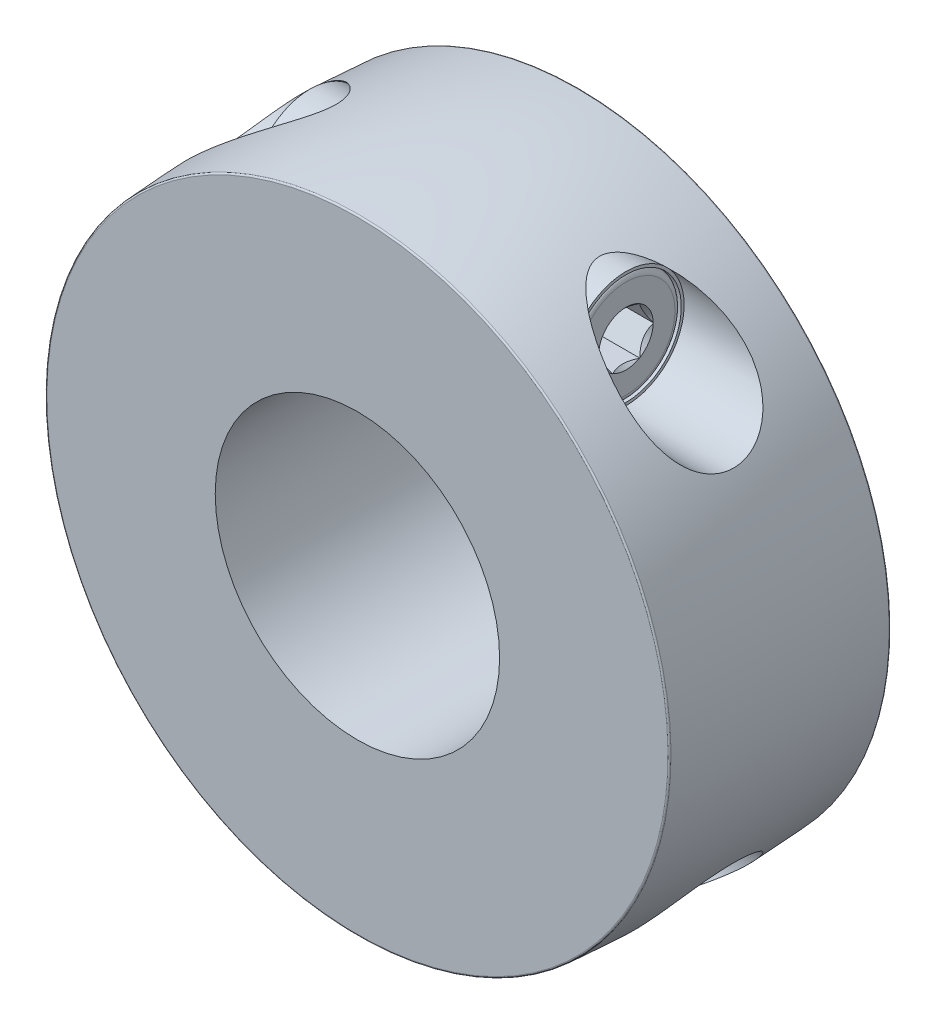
ISO-10303-21;
HEADER;
FILE_DESCRIPTION(('STEP AP214'),'2;1');
FILE_NAME('part.step','',(''),(''),'','','');
FILE_SCHEMA(('AUTOMOTIVE_DESIGN { 1 0 10303 214 1 1 1 1 }'));
ENDSEC;
DATA;
#1=APPLICATION_CONTEXT('core data for automotive mechanical design processes');
#2=APPLICATION_PROTOCOL_DEFINITION('international standard','automotive_design',2000,#1);
#3=PRODUCT_CONTEXT('',#1,'mechanical');
#4=PRODUCT('Part','Part','',(#3));
#5=PRODUCT_RELATED_PRODUCT_CATEGORY('part','',(#4));
#6=PRODUCT_DEFINITION_FORMATION('','',#4);
#7=PRODUCT_DEFINITION_CONTEXT('part definition',#1,'design');
#8=PRODUCT_DEFINITION('design','',#6,#7);
#9=PRODUCT_DEFINITION_SHAPE('','',#8);
#10=(LENGTH_UNIT() NAMED_UNIT(*) SI_UNIT(.MILLI.,.METRE.));
#11=(NAMED_UNIT(*) PLANE_ANGLE_UNIT() SI_UNIT($,.RADIAN.));
#12=(NAMED_UNIT(*) SI_UNIT($,.STERADIAN.) SOLID_ANGLE_UNIT());
#13=UNCERTAINTY_MEASURE_WITH_UNIT(LENGTH_MEASURE(1.E-05),#10,'distance_accuracy_value','');
#14=(GEOMETRIC_REPRESENTATION_CONTEXT(3) GLOBAL_UNCERTAINTY_ASSIGNED_CONTEXT((#13)) GLOBAL_UNIT_ASSIGNED_CONTEXT((#10,
#11,#12)) REPRESENTATION_CONTEXT('',''));
#15=CARTESIAN_POINT('',(0.,0.,0.));
#16=DIRECTION('',(0.,0.,1.));
#17=DIRECTION('',(1.,0.,0.));
#18=AXIS2_PLACEMENT_3D('',#15,#16,#17);
#19=CARTESIAN_POINT('',(-10.,-16.0705,7.));
#20=DIRECTION('',(1.,0.,0.));
#21=DIRECTION('',(0.,1.,0.));
#22=AXIS2_PLACEMENT_3D('',#19,#20,#21);
#23=PLANE('',#22);
#24=CARTESIAN_POINT('',(-10.,-14.5,7.));
#25=DIRECTION('',(-1.,0.,0.));
#26=DIRECTION('',(0.,-1.,0.));
#27=AXIS2_PLACEMENT_3D('',#24,#25,#26);
#28=CIRCLE('',#27,1.5705);
#29=CARTESIAN_POINT('',(-10.,-16.0705,7.));
#30=VERTEX_POINT('',#29);
#31=EDGE_CURVE('E1269',#30,#30,#28,.T.);
#32=ORIENTED_EDGE('',*,*,#31,.T.);
#33=EDGE_LOOP('',(#32));
#34=FACE_BOUND('',#33,.T.);
#35=ADVANCED_FACE('F14',(#34),#23,.F.);
#36=CARTESIAN_POINT('',(-9.5705,-14.5,7.));
#37=DIRECTION('',(1.,0.,0.));
#38=DIRECTION('',(0.,1.,0.));
#39=AXIS2_PLACEMENT_3D('',#36,#37,#38);
#40=CONICAL_SURFACE('',#39,2.,0.785398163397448);
#41=ORIENTED_EDGE('',*,*,#31,.F.);
#42=EDGE_LOOP('',(#41));
#43=FACE_BOUND('',#42,.T.);
#44=CARTESIAN_POINT('',(-9.5705,-14.5,7.));
#45=DIRECTION('',(-1.,0.,0.));
#46=DIRECTION('',(0.,-1.,0.));
#47=AXIS2_PLACEMENT_3D('',#44,#45,#46);
#48=CIRCLE('',#47,2.);
#49=CARTESIAN_POINT('',(-9.5705,-16.5,7.));
#50=VERTEX_POINT('',#49);
#51=EDGE_CURVE('E1384',#50,#50,#48,.T.);
#52=ORIENTED_EDGE('',*,*,#51,.T.);
#53=EDGE_LOOP('',(#52));
#54=FACE_BOUND('',#53,.T.);
#55=ADVANCED_FACE('F268',(#43,#54),#40,.T.);
#56=CARTESIAN_POINT('',(9.78,-14.5,7.));
#57=DIRECTION('',(1.,0.,0.));
#58=DIRECTION('',(0.,1.,0.));
#59=AXIS2_PLACEMENT_3D('',#56,#57,#58);
#60=CONICAL_SURFACE('',#59,1.5,0.78539816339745);
#61=CARTESIAN_POINT('',(10.,-14.5,7.));
#62=DIRECTION('',(-1.,0.,0.));
#63=DIRECTION('',(0.,-1.,0.));
#64=AXIS2_PLACEMENT_3D('',#61,#62,#63);
#65=CIRCLE('',#64,1.72);
#66=CARTESIAN_POINT('',(10.,-14.4789032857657,8.71987061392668));
#67=VERTEX_POINT('',#66);
#68=CARTESIAN_POINT('',(10.,-13.0210967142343,7.87820559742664));
#69=VERTEX_POINT('',#68);
#70=EDGE_CURVE('E476',#67,#69,#65,.T.);
#71=ORIENTED_EDGE('',*,*,#70,.F.);
#72=CARTESIAN_POINT('',(10.0002,-14.4792571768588,8.72007493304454));
#73=CARTESIAN_POINT('',(9.97177013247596,-14.4289210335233,8.69101334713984));
#74=CARTESIAN_POINT('',(9.94506567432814,-14.377755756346,8.66147306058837));
#75=CARTESIAN_POINT('',(9.8962710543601,-14.2734949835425,8.60127807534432));
#76=CARTESIAN_POINT('',(9.87420644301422,-14.2203905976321,8.57061824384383));
#77=CARTESIAN_POINT('',(9.83647132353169,-14.1133231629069,8.50880283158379));
#78=CARTESIAN_POINT('',(9.82071053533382,-14.059384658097,8.47766142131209));
#79=CARTESIAN_POINT('',(9.79649081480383,-13.9503801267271,8.41472762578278));
#80=CARTESIAN_POINT('',(9.78801504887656,-13.8953170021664,8.38293691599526));
#81=CARTESIAN_POINT('',(9.78035173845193,-13.7993955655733,8.3275566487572));
#82=CARTESIAN_POINT('',(9.77929632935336,-13.75864509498,8.30402935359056));
#83=CARTESIAN_POINT('',(9.78161738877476,-13.6772272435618,8.2570227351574));
#84=CARTESIAN_POINT('',(9.78499492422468,-13.6365598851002,8.23354342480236));
#85=CARTESIAN_POINT('',(9.79598635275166,-13.5556318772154,8.1868196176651));
#86=CARTESIAN_POINT('',(9.80360366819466,-13.5153715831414,8.16357532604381));
#87=CARTESIAN_POINT('',(9.82266658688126,-13.4355291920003,8.11747830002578));
#88=CARTESIAN_POINT('',(9.83411377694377,-13.3959473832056,8.09462573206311));
#89=CARTESIAN_POINT('',(9.86660941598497,-13.2987979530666,8.03853648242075));
#90=CARTESIAN_POINT('',(9.88962799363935,-13.2417317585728,8.00558929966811));
#91=CARTESIAN_POINT('',(9.94118560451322,-13.1296999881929,7.9409077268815));
#92=CARTESIAN_POINT('',(9.96970614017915,-13.0747280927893,7.90916968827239));
#93=CARTESIAN_POINT('',(10.0002000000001,-13.020742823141,7.87800127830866));
#94=B_SPLINE_CURVE_WITH_KNOTS('',3,(#72,#73,#74,#75,#76,#77,#78,#79,#80,#81,#82,#83,#84,#85,#86,
#87,#88,#89,#90,#91,#92,#93),.UNSPECIFIED.,.F.,.F.,(4,2,2,2,2,2,2,2,2,2,4),(0.,
0.194237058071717,0.389517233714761,0.58189091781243,0.773818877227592,0.914817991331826,
1.05585104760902,1.1969981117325,1.33820372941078,1.54729349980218,1.75569219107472),.UNSPECIFIED.);
#95=EDGE_CURVE('E344',#67,#69,#94,.T.);
#96=ORIENTED_EDGE('',*,*,#95,.T.);
#97=EDGE_LOOP('',(#71,#96));
#98=FACE_BOUND('',#97,.T.);
#99=ADVANCED_FACE('F275',(#98),#60,.F.);
#100=CARTESIAN_POINT('',(10.,-13.,7.84166501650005));
#101=VERTEX_POINT('',#100);
#102=CARTESIAN_POINT('',(10.,-13.,6.15833498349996));
#103=VERTEX_POINT('',#102);
#104=EDGE_CURVE('E472',#101,#103,#65,.T.);
#105=ORIENTED_EDGE('',*,*,#104,.F.);
#106=CARTESIAN_POINT('',(10.6249673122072,-13.,5.19753732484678));
#107=CARTESIAN_POINT('',(10.5914851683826,-13.,5.24110341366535));
#108=CARTESIAN_POINT('',(10.5583089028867,-13.,5.28490384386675));
#109=CARTESIAN_POINT('',(10.492696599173,-13.,5.37307125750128));
#110=CARTESIAN_POINT('',(10.4602607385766,-13.,5.4174383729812));
#111=CARTESIAN_POINT('',(10.3637934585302,-13.,5.55218540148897));
#112=CARTESIAN_POINT('',(10.3011161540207,-13.,5.64355070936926));
#113=CARTESIAN_POINT('',(10.1773584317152,-13.,5.83564255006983));
#114=CARTESIAN_POINT('',(10.116626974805,-13.,5.93659630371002));
#115=CARTESIAN_POINT('',(10.0050441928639,-13.,6.14363767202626));
#116=CARTESIAN_POINT('',(9.95415949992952,-13.,6.24970637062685));
#117=CARTESIAN_POINT('',(9.89188581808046,-13.,6.40821381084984));
#118=CARTESIAN_POINT('',(9.87414570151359,-13.,6.45814416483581));
#119=CARTESIAN_POINT('',(9.8426664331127,-13.,6.55927614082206));
#120=CARTESIAN_POINT('',(9.82892753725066,-13.,6.61047784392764));
#121=CARTESIAN_POINT('',(9.80641705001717,-13.,6.71295330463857));
#122=CARTESIAN_POINT('',(9.79755555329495,-13.,6.76420698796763));
#123=CARTESIAN_POINT('',(9.78498529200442,-13.,6.86734605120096));
#124=CARTESIAN_POINT('',(9.78127547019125,-13.,6.91923129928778));
#125=CARTESIAN_POINT('',(9.77932180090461,-13.,7.02086093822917));
#126=CARTESIAN_POINT('',(9.7808487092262,-13.,7.07060096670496));
#127=CARTESIAN_POINT('',(9.78875923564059,-13.,7.16969048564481));
#128=CARTESIAN_POINT('',(9.79514329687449,-13.,7.21903994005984));
#129=CARTESIAN_POINT('',(9.81251592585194,-13.,7.31782838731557));
#130=CARTESIAN_POINT('',(9.82358560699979,-13.,7.36725288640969));
#131=CARTESIAN_POINT('',(9.84971863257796,-13.,7.4650110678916));
#132=CARTESIAN_POINT('',(9.86478174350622,-13.,7.51334481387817));
#133=CARTESIAN_POINT('',(9.91694837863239,-13.,7.66227110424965));
#134=CARTESIAN_POINT('',(9.95985478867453,-13.,7.76082489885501));
#135=CARTESIAN_POINT('',(10.0553326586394,-13.,7.95332810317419));
#136=CARTESIAN_POINT('',(10.1079382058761,-13.,8.04725974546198));
#137=CARTESIAN_POINT('',(10.2165541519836,-13.,8.22681545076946));
#138=CARTESIAN_POINT('',(10.2722686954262,-13.,8.31262076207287));
#139=CARTESIAN_POINT('',(10.358435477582,-13.,8.43903678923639));
#140=CARTESIAN_POINT('',(10.3874689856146,-13.,8.48063160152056));
#141=CARTESIAN_POINT('',(10.446313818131,-13.,8.56325069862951));
#142=CARTESIAN_POINT('',(10.4761249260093,-13.,8.60427513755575));
#143=CARTESIAN_POINT('',(10.5062587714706,-13.,8.64506173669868));
#144=B_SPLINE_CURVE_WITH_KNOTS('',3,(#106,#107,#108,#109,#110,#111,#112,#113,#114,#115,#116,
#117,#118,#119,#120,#121,#122,#123,#124,#125,#126,#127,#128,#129,#130,#131,#132,#133,#134,#135,
#136,#137,#138,#139,#140,#141,#142,#143),.UNSPECIFIED.,.F.,.F.,(4,2,2,2,2,2,2,2,2,2,2,2,2,2,2,2,
2,2,4),(0.,0.164833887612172,0.329706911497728,0.661961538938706,1.01513388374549,
1.36708762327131,1.52591950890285,1.68476155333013,1.84056821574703,1.99634289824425,
2.14538697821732,2.29444465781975,2.44619562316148,2.59793771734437,2.91946486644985,
3.24214433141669,3.548910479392,3.70108091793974,3.85320941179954),.UNSPECIFIED.);
#145=EDGE_CURVE('E338',#101,#103,#144,.F.);
#146=ORIENTED_EDGE('',*,*,#145,.T.);
#147=EDGE_LOOP('',(#105,#146));
#148=FACE_BOUND('',#147,.T.);
#149=ADVANCED_FACE('F1131',(#148),#60,.F.);
#150=CARTESIAN_POINT('',(10.,-13.0210967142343,6.12179440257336));
#151=VERTEX_POINT('',#150);
#152=CARTESIAN_POINT('',(10.,-14.4789032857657,5.28012938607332));
#153=VERTEX_POINT('',#152);
#154=EDGE_CURVE('E458',#151,#153,#65,.T.);
#155=ORIENTED_EDGE('',*,*,#154,.F.);
#156=CARTESIAN_POINT('',(10.0002000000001,-13.020742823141,6.12199872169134));
#157=CARTESIAN_POINT('',(9.97177013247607,-13.0710789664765,6.09293713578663));
#158=CARTESIAN_POINT('',(9.94506567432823,-13.1222442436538,6.06339684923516));
#159=CARTESIAN_POINT('',(9.89627105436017,-13.2265050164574,6.00320186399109));
#160=CARTESIAN_POINT('',(9.87420644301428,-13.2796094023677,5.97254203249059));
#161=CARTESIAN_POINT('',(9.83647132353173,-13.386676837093,5.91072662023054));
#162=CARTESIAN_POINT('',(9.82071053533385,-13.4406153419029,5.87958520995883));
#163=CARTESIAN_POINT('',(9.79649081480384,-13.5496198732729,5.8166514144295));
#164=CARTESIAN_POINT('',(9.78801504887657,-13.6046829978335,5.78486070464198));
#165=CARTESIAN_POINT('',(9.78035173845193,-13.7006044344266,5.72948043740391));
#166=CARTESIAN_POINT('',(9.77929632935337,-13.7413549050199,5.70595314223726));
#167=CARTESIAN_POINT('',(9.78161738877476,-13.8227727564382,5.6589465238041));
#168=CARTESIAN_POINT('',(9.78499492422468,-13.8634401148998,5.63546721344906));
#169=CARTESIAN_POINT('',(9.79598635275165,-13.9443681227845,5.5887434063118));
#170=CARTESIAN_POINT('',(9.80360366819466,-13.9846284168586,5.56549911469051));
#171=CARTESIAN_POINT('',(9.82266658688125,-14.0644708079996,5.51940208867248));
#172=CARTESIAN_POINT('',(9.83411377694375,-14.1040526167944,5.49654952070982));
#173=CARTESIAN_POINT('',(9.86660941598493,-14.2012020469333,5.44046027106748));
#174=CARTESIAN_POINT('',(9.88962799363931,-14.2582682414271,5.40751308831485));
#175=CARTESIAN_POINT('',(9.94118560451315,-14.3703000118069,5.34283151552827));
#176=CARTESIAN_POINT('',(9.96970614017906,-14.4252719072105,5.31109347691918));
#177=CARTESIAN_POINT('',(10.0002,-14.4792571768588,5.27992506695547));
#178=B_SPLINE_CURVE_WITH_KNOTS('',3,(#156,#157,#158,#159,#160,#161,#162,#163,#164,#165,#166,
#167,#168,#169,#170,#171,#172,#173,#174,#175,#176,#177),.UNSPECIFIED.,.F.,.F.,(4,2,2,2,2,2,2,2,
2,2,4),(0.,0.194237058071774,0.389517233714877,0.581890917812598,0.773818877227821,
0.914817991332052,1.05585104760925,1.19699811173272,1.33820372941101,1.54729349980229,
1.75569219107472),.UNSPECIFIED.);
#179=EDGE_CURVE('E331',#151,#153,#178,.T.);
#180=ORIENTED_EDGE('',*,*,#179,.T.);
#181=EDGE_LOOP('',(#155,#180));
#182=FACE_BOUND('',#181,.T.);
#183=ADVANCED_FACE('F456',(#182),#60,.F.);
#184=CARTESIAN_POINT('',(10.,-14.5210967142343,5.28012938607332));
#185=VERTEX_POINT('',#184);
#186=CARTESIAN_POINT('',(10.,-15.9789032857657,6.12179440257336));
#187=VERTEX_POINT('',#186);
#188=EDGE_CURVE('E473',#185,#187,#65,.T.);
#189=ORIENTED_EDGE('',*,*,#188,.F.);
#190=CARTESIAN_POINT('',(10.0002,-14.5207428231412,5.27992506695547));
#191=CARTESIAN_POINT('',(9.97177013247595,-14.5710789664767,5.30898665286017));
#192=CARTESIAN_POINT('',(9.94506567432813,-14.622244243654,5.33852693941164));
#193=CARTESIAN_POINT('',(9.89627105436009,-14.7265050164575,5.39872192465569));
#194=CARTESIAN_POINT('',(9.87420644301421,-14.7796094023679,5.42938175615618));
#195=CARTESIAN_POINT('',(9.83647132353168,-14.8866768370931,5.49119716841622));
#196=CARTESIAN_POINT('',(9.82071053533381,-14.940615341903,5.52233857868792));
#197=CARTESIAN_POINT('',(9.79649081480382,-15.0496198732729,5.58527237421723));
#198=CARTESIAN_POINT('',(9.78801504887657,-15.1046829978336,5.61706308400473));
#199=CARTESIAN_POINT('',(9.78035173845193,-15.2006044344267,5.6724433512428));
#200=CARTESIAN_POINT('',(9.77929632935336,-15.24135490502,5.69597064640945));
#201=CARTESIAN_POINT('',(9.78161738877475,-15.3227727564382,5.74297726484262));
#202=CARTESIAN_POINT('',(9.78499492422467,-15.3634401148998,5.76645657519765));
#203=CARTESIAN_POINT('',(9.79598635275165,-15.4443681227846,5.81318038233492));
#204=CARTESIAN_POINT('',(9.80360366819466,-15.4846284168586,5.83642467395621));
#205=CARTESIAN_POINT('',(9.82266658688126,-15.5644708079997,5.88252169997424));
#206=CARTESIAN_POINT('',(9.83411377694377,-15.6040526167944,5.9053742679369));
#207=CARTESIAN_POINT('',(9.86660941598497,-15.7012020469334,5.96146351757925));
#208=CARTESIAN_POINT('',(9.88962799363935,-15.7582682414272,5.9944107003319));
#209=CARTESIAN_POINT('',(9.94118560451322,-15.8703000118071,6.05909227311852));
#210=CARTESIAN_POINT('',(9.96970614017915,-15.9252719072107,6.09083031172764));
#211=CARTESIAN_POINT('',(10.0002000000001,-15.979257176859,6.12199872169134));
#212=B_SPLINE_CURVE_WITH_KNOTS('',3,(#190,#191,#192,#193,#194,#195,#196,#197,#198,#199,#200,
#201,#202,#203,#204,#205,#206,#207,#208,#209,#210,#211),.UNSPECIFIED.,.F.,.F.,(4,2,2,2,2,2,2,2,
2,2,4),(0.,0.194237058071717,0.389517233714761,0.581890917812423,0.77381887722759,
0.914817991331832,1.05585104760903,1.19699811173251,1.3382037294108,1.54729349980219,
1.75569219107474),.UNSPECIFIED.);
#213=EDGE_CURVE('E324',#185,#187,#212,.T.);
#214=ORIENTED_EDGE('',*,*,#213,.T.);
#215=EDGE_LOOP('',(#189,#214));
#216=FACE_BOUND('',#215,.T.);
#217=ADVANCED_FACE('F1213',(#216),#60,.F.);
#218=CARTESIAN_POINT('',(10.,-16.,6.15833498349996));
#219=VERTEX_POINT('',#218);
#220=CARTESIAN_POINT('',(10.,-16.,7.84166501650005));
#221=VERTEX_POINT('',#220);
#222=EDGE_CURVE('E478',#219,#221,#65,.T.);
#223=ORIENTED_EDGE('',*,*,#222,.F.);
#224=CARTESIAN_POINT('',(10.6249673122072,-16.,5.19753732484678));
#225=CARTESIAN_POINT('',(10.5914851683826,-16.,5.24110341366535));
#226=CARTESIAN_POINT('',(10.5583089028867,-16.,5.28490384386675));
#227=CARTESIAN_POINT('',(10.492696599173,-16.,5.37307125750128));
#228=CARTESIAN_POINT('',(10.4602607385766,-16.,5.4174383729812));
#229=CARTESIAN_POINT('',(10.3637934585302,-16.,5.55218540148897));
#230=CARTESIAN_POINT('',(10.3011161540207,-16.,5.64355070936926));
#231=CARTESIAN_POINT('',(10.1773584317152,-16.,5.83564255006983));
#232=CARTESIAN_POINT('',(10.116626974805,-16.,5.93659630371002));
#233=CARTESIAN_POINT('',(10.0050441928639,-16.,6.14363767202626));
#234=CARTESIAN_POINT('',(9.95415949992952,-16.,6.24970637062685));
#235=CARTESIAN_POINT('',(9.89188581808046,-16.,6.40821381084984));
#236=CARTESIAN_POINT('',(9.87414570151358,-16.,6.45814416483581));
#237=CARTESIAN_POINT('',(9.8426664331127,-16.,6.55927614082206));
#238=CARTESIAN_POINT('',(9.82892753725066,-16.,6.61047784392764));
#239=CARTESIAN_POINT('',(9.80641705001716,-16.,6.71295330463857));
#240=CARTESIAN_POINT('',(9.79755555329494,-16.,6.76420698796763));
#241=CARTESIAN_POINT('',(9.78498529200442,-16.,6.86734605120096));
#242=CARTESIAN_POINT('',(9.78127547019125,-16.,6.91923129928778));
#243=CARTESIAN_POINT('',(9.77932180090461,-16.,7.02086093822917));
#244=CARTESIAN_POINT('',(9.7808487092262,-16.,7.07060096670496));
#245=CARTESIAN_POINT('',(9.78875923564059,-16.,7.16969048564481));
#246=CARTESIAN_POINT('',(9.79514329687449,-16.,7.21903994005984));
#247=CARTESIAN_POINT('',(9.81251592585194,-16.,7.31782838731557));
#248=CARTESIAN_POINT('',(9.82358560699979,-16.,7.36725288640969));
#249=CARTESIAN_POINT('',(9.84971863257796,-16.,7.4650110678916));
#250=CARTESIAN_POINT('',(9.86478174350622,-16.,7.51334481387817));
#251=CARTESIAN_POINT('',(9.91694837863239,-16.,7.66227110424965));
#252=CARTESIAN_POINT('',(9.95985478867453,-16.,7.76082489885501));
#253=CARTESIAN_POINT('',(10.0553326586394,-16.,7.95332810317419));
#254=CARTESIAN_POINT('',(10.1079382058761,-16.,8.04725974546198));
#255=CARTESIAN_POINT('',(10.2165541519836,-16.,8.22681545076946));
#256=CARTESIAN_POINT('',(10.2722686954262,-16.,8.31262076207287));
#257=CARTESIAN_POINT('',(10.358435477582,-16.,8.43903678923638));
#258=CARTESIAN_POINT('',(10.3874689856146,-16.,8.48063160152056));
#259=CARTESIAN_POINT('',(10.446313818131,-16.,8.56325069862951));
#260=CARTESIAN_POINT('',(10.4761249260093,-16.,8.60427513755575));
#261=CARTESIAN_POINT('',(10.5062587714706,-16.,8.64506173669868));
#262=B_SPLINE_CURVE_WITH_KNOTS('',3,(#224,#225,#226,#227,#228,#229,#230,#231,#232,#233,#234,
#235,#236,#237,#238,#239,#240,#241,#242,#243,#244,#245,#246,#247,#248,#249,#250,#251,#252,#253,
#254,#255,#256,#257,#258,#259,#260,#261),.UNSPECIFIED.,.F.,.F.,(4,2,2,2,2,2,2,2,2,2,2,2,2,2,2,2,
2,2,4),(0.,0.164833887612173,0.32970691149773,0.661961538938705,1.01513388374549,
1.36708762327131,1.52591950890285,1.68476155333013,1.84056821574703,1.99634289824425,
2.14538697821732,2.29444465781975,2.44619562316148,2.59793771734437,2.91946486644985,
3.24214433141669,3.548910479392,3.70108091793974,3.85320941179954),.UNSPECIFIED.);
#263=EDGE_CURVE('E316',#219,#221,#262,.T.);
#264=ORIENTED_EDGE('',*,*,#263,.T.);
#265=EDGE_LOOP('',(#223,#264));
#266=FACE_BOUND('',#265,.T.);
#267=ADVANCED_FACE('F298',(#266),#60,.F.);
#268=CARTESIAN_POINT('',(10.,-15.9789032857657,7.87820559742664));
#269=VERTEX_POINT('',#268);
#270=CARTESIAN_POINT('',(10.,-14.5210967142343,8.71987061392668));
#271=VERTEX_POINT('',#270);
#272=EDGE_CURVE('E482',#269,#271,#65,.T.);
#273=ORIENTED_EDGE('',*,*,#272,.F.);
#274=CARTESIAN_POINT('',(10.0002000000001,-15.979257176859,7.87800127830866));
#275=CARTESIAN_POINT('',(9.97177013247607,-15.9289210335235,7.90706286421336));
#276=CARTESIAN_POINT('',(9.94506567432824,-15.8777557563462,7.93660315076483));
#277=CARTESIAN_POINT('',(9.89627105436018,-15.7734949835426,7.9967981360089));
#278=CARTESIAN_POINT('',(9.87420644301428,-15.7203905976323,8.0274579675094));
#279=CARTESIAN_POINT('',(9.83647132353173,-15.613323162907,8.08927337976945));
#280=CARTESIAN_POINT('',(9.82071053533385,-15.5593846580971,8.12041479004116));
#281=CARTESIAN_POINT('',(9.79649081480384,-15.4503801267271,8.1833485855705));
#282=CARTESIAN_POINT('',(9.78801504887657,-15.3953170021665,8.21513929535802));
#283=CARTESIAN_POINT('',(9.78035173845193,-15.2993955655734,8.27051956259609));
#284=CARTESIAN_POINT('',(9.77929632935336,-15.2586450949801,8.29404685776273));
#285=CARTESIAN_POINT('',(9.78161738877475,-15.1772272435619,8.3410534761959));
#286=CARTESIAN_POINT('',(9.78499492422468,-15.1365598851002,8.36453278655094));
#287=CARTESIAN_POINT('',(9.79598635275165,-15.0556318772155,8.4112565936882));
#288=CARTESIAN_POINT('',(9.80360366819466,-15.0153715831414,8.43450088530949));
#289=CARTESIAN_POINT('',(9.82266658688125,-14.9355291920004,8.48059791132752));
#290=CARTESIAN_POINT('',(9.83411377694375,-14.8959473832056,8.50345047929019));
#291=CARTESIAN_POINT('',(9.86660941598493,-14.7987979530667,8.55953972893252));
#292=CARTESIAN_POINT('',(9.88962799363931,-14.7417317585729,8.59248691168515));
#293=CARTESIAN_POINT('',(9.94118560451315,-14.6296999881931,8.65716848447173));
#294=CARTESIAN_POINT('',(9.96970614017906,-14.5747280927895,8.68890652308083));
#295=CARTESIAN_POINT('',(10.0002,-14.5207428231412,8.72007493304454));
#296=B_SPLINE_CURVE_WITH_KNOTS('',3,(#274,#275,#276,#277,#278,#279,#280,#281,#282,#283,#284,
#285,#286,#287,#288,#289,#290,#291,#292,#293,#294,#295),.UNSPECIFIED.,.F.,.F.,(4,2,2,2,2,2,2,2,
2,2,4),(0.,0.194237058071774,0.389517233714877,0.581890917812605,0.773818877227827,
0.914817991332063,1.05585104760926,1.19699811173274,1.33820372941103,1.54729349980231,
1.75569219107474),.UNSPECIFIED.);
#297=EDGE_CURVE('E305',#269,#271,#296,.T.);
#298=ORIENTED_EDGE('',*,*,#297,.T.);
#299=EDGE_LOOP('',(#273,#298));
#300=FACE_BOUND('',#299,.T.);
#301=ADVANCED_FACE('F293',(#300),#60,.F.);
#302=CARTESIAN_POINT('',(10.,-16.22,7.));
#303=DIRECTION('',(-1.,0.,0.));
#304=DIRECTION('',(0.,-1.,0.));
#305=AXIS2_PLACEMENT_3D('',#302,#303,#304);
#306=PLANE('',#305);
#307=CARTESIAN_POINT('',(10.,-14.5,7.));
#308=DIRECTION('',(-1.,0.,0.));
#309=DIRECTION('',(0.,-1.,0.));
#310=AXIS2_PLACEMENT_3D('',#307,#308,#309);
#311=CIRCLE('',#310,3.1);
#312=CARTESIAN_POINT('',(10.,-17.6,7.));
#313=VERTEX_POINT('',#312);
#314=EDGE_CURVE('E477',#313,#313,#311,.T.);
#315=ORIENTED_EDGE('',*,*,#314,.F.);
#316=EDGE_LOOP('',(#315));
#317=FACE_BOUND('',#316,.T.);
#318=ORIENTED_EDGE('',*,*,#70,.T.);
#319=DIRECTION('',(0.,0.866025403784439,-0.5));
#320=VECTOR('',#319,1.);
#321=CARTESIAN_POINT('',(10.,-15.04,9.04381995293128));
#322=LINE('',#321,#320);
#323=CARTESIAN_POINT('',(10.,-13.,7.86602540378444));
#324=VERTEX_POINT('',#323);
#325=EDGE_CURVE('E9',#69,#324,#322,.T.);
#326=ORIENTED_EDGE('',*,*,#325,.T.);
#327=DIRECTION('',(0.,0.,-1.));
#328=VECTOR('',#327,1.);
#329=CARTESIAN_POINT('',(10.,-13.,7.));
#330=LINE('',#329,#328);
#331=EDGE_CURVE('E30',#324,#101,#330,.T.);
#332=ORIENTED_EDGE('',*,*,#331,.T.);
#333=ORIENTED_EDGE('',*,*,#104,.T.);
#334=CARTESIAN_POINT('',(10.,-13.,6.13397459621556));
#335=VERTEX_POINT('',#334);
#336=EDGE_CURVE('E500',#103,#335,#330,.T.);
#337=ORIENTED_EDGE('',*,*,#336,.T.);
#338=DIRECTION('',(0.,-0.866025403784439,-0.5));
#339=VECTOR('',#338,1.);
#340=CARTESIAN_POINT('',(10.,-15.04,4.95618004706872));
#341=LINE('',#340,#339);
#342=EDGE_CURVE('E471',#335,#151,#341,.T.);
#343=ORIENTED_EDGE('',*,*,#342,.T.);
#344=ORIENTED_EDGE('',*,*,#154,.T.);
#345=CARTESIAN_POINT('',(10.,-14.5,5.26794919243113));
#346=VERTEX_POINT('',#345);
#347=EDGE_CURVE('E469',#153,#346,#341,.T.);
#348=ORIENTED_EDGE('',*,*,#347,.T.);
#349=DIRECTION('',(0.,-0.866025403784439,0.5));
#350=VECTOR('',#349,1.);
#351=CARTESIAN_POINT('',(10.,-16.54,6.44574374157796));
#352=LINE('',#351,#350);
#353=EDGE_CURVE('E498',#346,#185,#352,.T.);
#354=ORIENTED_EDGE('',*,*,#353,.T.);
#355=ORIENTED_EDGE('',*,*,#188,.T.);
#356=CARTESIAN_POINT('',(10.,-16.,6.13397459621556));
#357=VERTEX_POINT('',#356);
#358=EDGE_CURVE('E495',#187,#357,#352,.T.);
#359=ORIENTED_EDGE('',*,*,#358,.T.);
#360=DIRECTION('',(0.,0.,1.));
#361=VECTOR('',#360,1.);
#362=CARTESIAN_POINT('',(10.,-16.,7.));
#363=LINE('',#362,#361);
#364=EDGE_CURVE('E494',#357,#219,#363,.T.);
#365=ORIENTED_EDGE('',*,*,#364,.T.);
#366=ORIENTED_EDGE('',*,*,#222,.T.);
#367=CARTESIAN_POINT('',(10.,-16.,7.86602540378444));
#368=VERTEX_POINT('',#367);
#369=EDGE_CURVE('E491',#221,#368,#363,.T.);
#370=ORIENTED_EDGE('',*,*,#369,.T.);
#371=DIRECTION('',(0.,0.866025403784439,0.5));
#372=VECTOR('',#371,1.);
#373=CARTESIAN_POINT('',(10.,-16.54,7.55425625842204));
#374=LINE('',#373,#372);
#375=EDGE_CURVE('E488',#368,#269,#374,.T.);
#376=ORIENTED_EDGE('',*,*,#375,.T.);
#377=ORIENTED_EDGE('',*,*,#272,.T.);
#378=CARTESIAN_POINT('',(10.,-14.5,8.73205080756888));
#379=VERTEX_POINT('',#378);
#380=EDGE_CURVE('E485',#271,#379,#374,.T.);
#381=ORIENTED_EDGE('',*,*,#380,.T.);
#382=EDGE_CURVE('E32',#379,#67,#322,.T.);
#383=ORIENTED_EDGE('',*,*,#382,.T.);
#384=EDGE_LOOP('',(#318,#326,#332,#333,#337,#343,#344,#348,#354,#355,#359,#365,#366,#370,#376,
#377,#381,#383));
#385=FACE_BOUND('',#384,.T.);
#386=ADVANCED_FACE('F289',(#317,#385),#306,.F.);
#387=CARTESIAN_POINT('',(9.6,-14.5,7.));
#388=DIRECTION('',(-1.,0.,0.));
#389=DIRECTION('',(0.,-1.,0.));
#390=AXIS2_PLACEMENT_3D('',#387,#388,#389);
#391=TOROIDAL_SURFACE('',#390,3.1,0.4);
#392=ORIENTED_EDGE('',*,*,#314,.T.);
#393=EDGE_LOOP('',(#392));
#394=FACE_BOUND('',#393,.T.);
#395=CARTESIAN_POINT('',(9.6,-14.5,7.));
#396=DIRECTION('',(-1.,0.,0.));
#397=DIRECTION('',(0.,-1.,0.));
#398=AXIS2_PLACEMENT_3D('',#395,#396,#397);
#399=CIRCLE('',#398,3.5);
#400=CARTESIAN_POINT('',(9.6,-18.,7.));
#401=VERTEX_POINT('',#400);
#402=EDGE_CURVE('E1387',#401,#401,#399,.T.);
#403=ORIENTED_EDGE('',*,*,#402,.F.);
#404=EDGE_LOOP('',(#403));
#405=FACE_BOUND('',#404,.T.);
#406=ADVANCED_FACE('F285',(#394,#405),#391,.T.);
#407=CARTESIAN_POINT('',(7.4,-14.5,7.));
#408=DIRECTION('',(-1.,0.,0.));
#409=DIRECTION('',(0.,-1.,0.));
#410=AXIS2_PLACEMENT_3D('',#407,#408,#409);
#411=PLANE('',#410);
#412=DIRECTION('',(0.,0.,1.));
#413=VECTOR('',#412,1.);
#414=CARTESIAN_POINT('',(7.4,-16.,6.13397459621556));
#415=LINE('',#414,#413);
#416=CARTESIAN_POINT('',(7.4,-16.,6.13397459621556));
#417=VERTEX_POINT('',#416);
#418=CARTESIAN_POINT('',(7.4,-16.,7.));
#419=VERTEX_POINT('',#418);
#420=EDGE_CURVE('E414',#417,#419,#415,.T.);
#421=ORIENTED_EDGE('',*,*,#420,.F.);
#422=DIRECTION('',(0.,-0.866025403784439,0.5));
#423=VECTOR('',#422,1.);
#424=CARTESIAN_POINT('',(7.4,-14.5,5.26794919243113));
#425=LINE('',#424,#423);
#426=CARTESIAN_POINT('',(7.4,-15.25,5.70096189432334));
#427=VERTEX_POINT('',#426);
#428=EDGE_CURVE('E1299',#427,#417,#425,.T.);
#429=ORIENTED_EDGE('',*,*,#428,.F.);
#430=CARTESIAN_POINT('',(7.4,-14.5,7.));
#431=DIRECTION('',(-1.,0.,0.));
#432=DIRECTION('',(0.,-1.,0.));
#433=AXIS2_PLACEMENT_3D('',#430,#431,#432);
#434=CIRCLE('',#433,1.5);
#435=EDGE_CURVE('E481',#427,#419,#434,.T.);
#436=ORIENTED_EDGE('',*,*,#435,.T.);
#437=EDGE_LOOP('',(#421,#429,#436));
#438=FACE_BOUND('',#437,.T.);
#439=ADVANCED_FACE('F288',(#438),#411,.F.);
#440=CARTESIAN_POINT('',(7.4,-14.5,5.26794919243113));
#441=VERTEX_POINT('',#440);
#442=EDGE_CURVE('E1291',#441,#427,#425,.T.);
#443=ORIENTED_EDGE('',*,*,#442,.F.);
#444=DIRECTION('',(0.,-0.866025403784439,-0.5));
#445=VECTOR('',#444,1.);
#446=CARTESIAN_POINT('',(7.4,-13.,6.13397459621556));
#447=LINE('',#446,#445);
#448=CARTESIAN_POINT('',(7.4,-13.75,5.70096189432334));
#449=VERTEX_POINT('',#448);
#450=EDGE_CURVE('E1293',#449,#441,#447,.T.);
#451=ORIENTED_EDGE('',*,*,#450,.F.);
#452=EDGE_CURVE('E1287',#449,#427,#434,.T.);
#453=ORIENTED_EDGE('',*,*,#452,.T.);
#454=EDGE_LOOP('',(#443,#451,#453));
#455=FACE_BOUND('',#454,.T.);
#456=ADVANCED_FACE('F371',(#455),#411,.F.);
#457=CARTESIAN_POINT('',(7.4,-13.,6.13397459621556));
#458=VERTEX_POINT('',#457);
#459=EDGE_CURVE('E1300',#458,#449,#447,.T.);
#460=ORIENTED_EDGE('',*,*,#459,.F.);
#461=DIRECTION('',(0.,0.,-1.));
#462=VECTOR('',#461,1.);
#463=CARTESIAN_POINT('',(7.4,-13.,7.86602540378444));
#464=LINE('',#463,#462);
#465=CARTESIAN_POINT('',(7.4,-13.,7.));
#466=VERTEX_POINT('',#465);
#467=EDGE_CURVE('E1311',#466,#458,#464,.T.);
#468=ORIENTED_EDGE('',*,*,#467,.F.);
#469=EDGE_CURVE('E1297',#466,#449,#434,.T.);
#470=ORIENTED_EDGE('',*,*,#469,.T.);
#471=EDGE_LOOP('',(#460,#468,#470));
#472=FACE_BOUND('',#471,.T.);
#473=ADVANCED_FACE('F378',(#472),#411,.F.);
#474=CARTESIAN_POINT('',(7.4,-13.,7.86602540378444));
#475=VERTEX_POINT('',#474);
#476=EDGE_CURVE('E1313',#475,#466,#464,.T.);
#477=ORIENTED_EDGE('',*,*,#476,.F.);
#478=DIRECTION('',(0.,0.866025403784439,-0.5));
#479=VECTOR('',#478,1.);
#480=CARTESIAN_POINT('',(7.4,-14.5,8.73205080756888));
#481=LINE('',#480,#479);
#482=CARTESIAN_POINT('',(7.4,-13.75,8.29903810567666));
#483=VERTEX_POINT('',#482);
#484=EDGE_CURVE('E1322',#483,#475,#481,.T.);
#485=ORIENTED_EDGE('',*,*,#484,.F.);
#486=EDGE_CURVE('E1303',#483,#466,#434,.T.);
#487=ORIENTED_EDGE('',*,*,#486,.T.);
#488=EDGE_LOOP('',(#477,#485,#487));
#489=FACE_BOUND('',#488,.T.);
#490=ADVANCED_FACE('F390',(#489),#411,.F.);
#491=CARTESIAN_POINT('',(7.4,-14.5,8.73205080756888));
#492=VERTEX_POINT('',#491);
#493=EDGE_CURVE('E1314',#492,#483,#481,.T.);
#494=ORIENTED_EDGE('',*,*,#493,.F.);
#495=DIRECTION('',(0.,0.866025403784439,0.5));
#496=VECTOR('',#495,1.);
#497=CARTESIAN_POINT('',(7.4,-16.,7.86602540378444));
#498=LINE('',#497,#496);
#499=CARTESIAN_POINT('',(7.4,-15.25,8.29903810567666));
#500=VERTEX_POINT('',#499);
#501=EDGE_CURVE('E410',#500,#492,#498,.T.);
#502=ORIENTED_EDGE('',*,*,#501,.F.);
#503=EDGE_CURVE('E486',#500,#483,#434,.T.);
#504=ORIENTED_EDGE('',*,*,#503,.T.);
#505=EDGE_LOOP('',(#494,#502,#504));
#506=FACE_BOUND('',#505,.T.);
#507=ADVANCED_FACE('F382',(#506),#411,.F.);
#508=CARTESIAN_POINT('',(7.4,-16.,7.86602540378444));
#509=VERTEX_POINT('',#508);
#510=EDGE_CURVE('E397',#509,#500,#498,.T.);
#511=ORIENTED_EDGE('',*,*,#510,.F.);
#512=EDGE_CURVE('E399',#419,#509,#415,.T.);
#513=ORIENTED_EDGE('',*,*,#512,.F.);
#514=EDGE_CURVE('E403',#419,#500,#434,.T.);
#515=ORIENTED_EDGE('',*,*,#514,.T.);
#516=EDGE_LOOP('',(#511,#513,#515));
#517=FACE_BOUND('',#516,.T.);
#518=ADVANCED_FACE('F373',(#517),#411,.F.);
#519=CARTESIAN_POINT('',(11.4,-14.5,8.73205080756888));
#520=DIRECTION('',(0.,0.5,0.866025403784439));
#521=DIRECTION('',(0.,0.866025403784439,-0.5));
#522=AXIS2_PLACEMENT_3D('',#519,#520,#521);
#523=PLANE('',#522);
#524=ORIENTED_EDGE('',*,*,#484,.T.);
#525=DIRECTION('',(-1.,0.,0.));
#526=VECTOR('',#525,1.);
#527=CARTESIAN_POINT('',(11.4,-13.,7.86602540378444));
#528=LINE('',#527,#526);
#529=EDGE_CURVE('E427',#324,#475,#528,.T.);
#530=ORIENTED_EDGE('',*,*,#529,.F.);
#531=ORIENTED_EDGE('',*,*,#325,.F.);
#532=ORIENTED_EDGE('',*,*,#95,.F.);
#533=ORIENTED_EDGE('',*,*,#382,.F.);
#534=DIRECTION('',(-1.,0.,0.));
#535=VECTOR('',#534,1.);
#536=CARTESIAN_POINT('',(11.4,-14.5,8.73205080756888));
#537=LINE('',#536,#535);
#538=EDGE_CURVE('E40',#379,#492,#537,.T.);
#539=ORIENTED_EDGE('',*,*,#538,.T.);
#540=ORIENTED_EDGE('',*,*,#493,.T.);
#541=EDGE_LOOP('',(#524,#530,#531,#532,#533,#539,#540));
#542=FACE_BOUND('',#541,.T.);
#543=ADVANCED_FACE('F281',(#542),#523,.F.);
#544=CARTESIAN_POINT('',(11.4,-13.,7.86602540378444));
#545=DIRECTION('',(0.,1.,0.));
#546=DIRECTION('',(-1.,0.,0.));
#547=AXIS2_PLACEMENT_3D('',#544,#545,#546);
#548=PLANE('',#547);
#549=ORIENTED_EDGE('',*,*,#467,.T.);
#550=DIRECTION('',(-1.,0.,0.));
#551=VECTOR('',#550,1.);
#552=CARTESIAN_POINT('',(11.4,-13.,6.13397459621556));
#553=LINE('',#552,#551);
#554=EDGE_CURVE('E425',#335,#458,#553,.T.);
#555=ORIENTED_EDGE('',*,*,#554,.F.);
#556=ORIENTED_EDGE('',*,*,#336,.F.);
#557=ORIENTED_EDGE('',*,*,#145,.F.);
#558=ORIENTED_EDGE('',*,*,#331,.F.);
#559=ORIENTED_EDGE('',*,*,#529,.T.);
#560=ORIENTED_EDGE('',*,*,#476,.T.);
#561=EDGE_LOOP('',(#549,#555,#556,#557,#558,#559,#560));
#562=FACE_BOUND('',#561,.T.);
#563=ADVANCED_FACE('F350',(#562),#548,.F.);
#564=CARTESIAN_POINT('',(11.4,-13.,6.13397459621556));
#565=DIRECTION('',(0.,0.5,-0.866025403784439));
#566=DIRECTION('',(0.,-0.866025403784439,-0.5));
#567=AXIS2_PLACEMENT_3D('',#564,#565,#566);
#568=PLANE('',#567);
#569=ORIENTED_EDGE('',*,*,#450,.T.);
#570=DIRECTION('',(-1.,0.,0.));
#571=VECTOR('',#570,1.);
#572=CARTESIAN_POINT('',(11.4,-14.5,5.26794919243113));
#573=LINE('',#572,#571);
#574=EDGE_CURVE('E422',#346,#441,#573,.T.);
#575=ORIENTED_EDGE('',*,*,#574,.F.);
#576=ORIENTED_EDGE('',*,*,#347,.F.);
#577=ORIENTED_EDGE('',*,*,#179,.F.);
#578=ORIENTED_EDGE('',*,*,#342,.F.);
#579=ORIENTED_EDGE('',*,*,#554,.T.);
#580=ORIENTED_EDGE('',*,*,#459,.T.);
#581=EDGE_LOOP('',(#569,#575,#576,#577,#578,#579,#580));
#582=FACE_BOUND('',#581,.T.);
#583=ADVANCED_FACE('F353',(#582),#568,.F.);
#584=CARTESIAN_POINT('',(11.4,-14.5,5.26794919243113));
#585=DIRECTION('',(0.,-0.5,-0.866025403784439));
#586=DIRECTION('',(0.,-0.866025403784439,0.5));
#587=AXIS2_PLACEMENT_3D('',#584,#585,#586);
#588=PLANE('',#587);
#589=ORIENTED_EDGE('',*,*,#428,.T.);
#590=DIRECTION('',(-1.,0.,0.));
#591=VECTOR('',#590,1.);
#592=CARTESIAN_POINT('',(11.4,-16.,6.13397459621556));
#593=LINE('',#592,#591);
#594=EDGE_CURVE('E419',#357,#417,#593,.T.);
#595=ORIENTED_EDGE('',*,*,#594,.F.);
#596=ORIENTED_EDGE('',*,*,#358,.F.);
#597=ORIENTED_EDGE('',*,*,#213,.F.);
#598=ORIENTED_EDGE('',*,*,#353,.F.);
#599=ORIENTED_EDGE('',*,*,#574,.T.);
#600=ORIENTED_EDGE('',*,*,#442,.T.);
#601=EDGE_LOOP('',(#589,#595,#596,#597,#598,#599,#600));
#602=FACE_BOUND('',#601,.T.);
#603=ADVANCED_FACE('F357',(#602),#588,.F.);
#604=CARTESIAN_POINT('',(11.4,-16.,6.13397459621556));
#605=DIRECTION('',(0.,-1.,0.));
#606=DIRECTION('',(1.,0.,0.));
#607=AXIS2_PLACEMENT_3D('',#604,#605,#606);
#608=PLANE('',#607);
#609=ORIENTED_EDGE('',*,*,#512,.T.);
#610=DIRECTION('',(-1.,0.,0.));
#611=VECTOR('',#610,1.);
#612=CARTESIAN_POINT('',(11.4,-16.,7.86602540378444));
#613=LINE('',#612,#611);
#614=EDGE_CURVE('E412',#368,#509,#613,.T.);
#615=ORIENTED_EDGE('',*,*,#614,.F.);
#616=ORIENTED_EDGE('',*,*,#369,.F.);
#617=ORIENTED_EDGE('',*,*,#263,.F.);
#618=ORIENTED_EDGE('',*,*,#364,.F.);
#619=ORIENTED_EDGE('',*,*,#594,.T.);
#620=ORIENTED_EDGE('',*,*,#420,.T.);
#621=EDGE_LOOP('',(#609,#615,#616,#617,#618,#619,#620));
#622=FACE_BOUND('',#621,.T.);
#623=ADVANCED_FACE('F361',(#622),#608,.F.);
#624=CARTESIAN_POINT('',(11.4,-16.,7.86602540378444));
#625=DIRECTION('',(0.,-0.5,0.866025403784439));
#626=DIRECTION('',(0.,0.866025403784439,0.5));
#627=AXIS2_PLACEMENT_3D('',#624,#625,#626);
#628=PLANE('',#627);
#629=ORIENTED_EDGE('',*,*,#501,.T.);
#630=ORIENTED_EDGE('',*,*,#538,.F.);
#631=ORIENTED_EDGE('',*,*,#380,.F.);
#632=ORIENTED_EDGE('',*,*,#297,.F.);
#633=ORIENTED_EDGE('',*,*,#375,.F.);
#634=ORIENTED_EDGE('',*,*,#614,.T.);
#635=ORIENTED_EDGE('',*,*,#510,.T.);
#636=EDGE_LOOP('',(#629,#630,#631,#632,#633,#634,#635));
#637=FACE_BOUND('',#636,.T.);
#638=ADVANCED_FACE('F365',(#637),#628,.F.);
#639=CARTESIAN_POINT('',(6.53397459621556,-14.5,7.));
#640=DIRECTION('',(1.,0.,0.));
#641=DIRECTION('',(0.,1.,0.));
#642=AXIS2_PLACEMENT_3D('',#639,#640,#641);
#643=CONICAL_SURFACE('',#642,0.,1.0471975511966);
#644=ORIENTED_EDGE('',*,*,#514,.F.);
#645=ORIENTED_EDGE('',*,*,#435,.F.);
#646=ORIENTED_EDGE('',*,*,#452,.F.);
#647=ORIENTED_EDGE('',*,*,#469,.F.);
#648=ORIENTED_EDGE('',*,*,#486,.F.);
#649=ORIENTED_EDGE('',*,*,#503,.F.);
#650=EDGE_LOOP('',(#644,#645,#646,#647,#648,#649));
#651=FACE_BOUND('',#650,.T.);
#652=CARTESIAN_POINT('',(6.53397459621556,-14.5,7.));
#653=VERTEX_POINT('',#652);
#654=VERTEX_LOOP('',#653);
#655=FACE_BOUND('',#654,.T.);
#656=ADVANCED_FACE('F300',(#651,#655),#643,.F.);
#657=CARTESIAN_POINT('',(6.53397459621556,14.5,7.));
#658=DIRECTION('',(1.,0.,0.));
#659=DIRECTION('',(0.,1.,0.));
#660=AXIS2_PLACEMENT_3D('',#657,#658,#659);
#661=CONICAL_SURFACE('',#660,0.,1.0471975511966);
#662=CARTESIAN_POINT('',(7.4,14.5,7.));
#663=DIRECTION('',(-1.,0.,0.));
#664=DIRECTION('',(0.,-1.,0.));
#665=AXIS2_PLACEMENT_3D('',#662,#663,#664);
#666=CIRCLE('',#665,1.5);
#667=CARTESIAN_POINT('',(7.4,13.,7.));
#668=VERTEX_POINT('',#667);
#669=CARTESIAN_POINT('',(7.4,13.75,8.29903810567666));
#670=VERTEX_POINT('',#669);
#671=EDGE_CURVE('E701',#668,#670,#666,.T.);
#672=ORIENTED_EDGE('',*,*,#671,.F.);
#673=CARTESIAN_POINT('',(7.4,13.75,5.70096189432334));
#674=VERTEX_POINT('',#673);
#675=EDGE_CURVE('E698',#674,#668,#666,.T.);
#676=ORIENTED_EDGE('',*,*,#675,.F.);
#677=CARTESIAN_POINT('',(7.4,15.25,5.70096189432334));
#678=VERTEX_POINT('',#677);
#679=EDGE_CURVE('E1341',#678,#674,#666,.T.);
#680=ORIENTED_EDGE('',*,*,#679,.F.);
#681=CARTESIAN_POINT('',(7.4,16.,7.));
#682=VERTEX_POINT('',#681);
#683=EDGE_CURVE('E1336',#682,#678,#666,.T.);
#684=ORIENTED_EDGE('',*,*,#683,.F.);
#685=CARTESIAN_POINT('',(7.4,15.25,8.29903810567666));
#686=VERTEX_POINT('',#685);
#687=EDGE_CURVE('E1331',#686,#682,#666,.T.);
#688=ORIENTED_EDGE('',*,*,#687,.F.);
#689=EDGE_CURVE('E704',#670,#686,#666,.T.);
#690=ORIENTED_EDGE('',*,*,#689,.F.);
#691=EDGE_LOOP('',(#672,#676,#680,#684,#688,#690));
#692=FACE_BOUND('',#691,.T.);
#693=CARTESIAN_POINT('',(6.53397459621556,14.5,7.));
#694=VERTEX_POINT('',#693);
#695=VERTEX_LOOP('',#694);
#696=FACE_BOUND('',#695,.T.);
#697=ADVANCED_FACE('F278',(#692,#696),#661,.F.);
#698=CARTESIAN_POINT('',(7.4,14.5,7.));
#699=DIRECTION('',(-1.,0.,0.));
#700=DIRECTION('',(0.,-1.,0.));
#701=AXIS2_PLACEMENT_3D('',#698,#699,#700);
#702=PLANE('',#701);
#703=DIRECTION('',(0.,0.866025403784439,0.5));
#704=VECTOR('',#703,1.);
#705=CARTESIAN_POINT('',(7.4,13.,7.86602540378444));
#706=LINE('',#705,#704);
#707=CARTESIAN_POINT('',(7.4,13.,7.86602540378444));
#708=VERTEX_POINT('',#707);
#709=EDGE_CURVE('E522',#708,#670,#706,.T.);
#710=ORIENTED_EDGE('',*,*,#709,.F.);
#711=DIRECTION('',(0.,0.,1.));
#712=VECTOR('',#711,1.);
#713=CARTESIAN_POINT('',(7.4,13.,6.13397459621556));
#714=LINE('',#713,#712);
#715=EDGE_CURVE('E518',#668,#708,#714,.T.);
#716=ORIENTED_EDGE('',*,*,#715,.F.);
#717=ORIENTED_EDGE('',*,*,#671,.T.);
#718=EDGE_LOOP('',(#710,#716,#717));
#719=FACE_BOUND('',#718,.T.);
#720=ADVANCED_FACE('F622',(#719),#702,.F.);
#721=CARTESIAN_POINT('',(7.4,13.,6.13397459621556));
#722=VERTEX_POINT('',#721);
#723=EDGE_CURVE('E519',#722,#668,#714,.T.);
#724=ORIENTED_EDGE('',*,*,#723,.F.);
#725=DIRECTION('',(0.,-0.866025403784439,0.5));
#726=VECTOR('',#725,1.);
#727=CARTESIAN_POINT('',(7.4,14.5,5.26794919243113));
#728=LINE('',#727,#726);
#729=EDGE_CURVE('E514',#674,#722,#728,.T.);
#730=ORIENTED_EDGE('',*,*,#729,.F.);
#731=ORIENTED_EDGE('',*,*,#675,.T.);
#732=EDGE_LOOP('',(#724,#730,#731));
#733=FACE_BOUND('',#732,.T.);
#734=ADVANCED_FACE('F568',(#733),#702,.F.);
#735=CARTESIAN_POINT('',(7.4,14.5,5.26794919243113));
#736=VERTEX_POINT('',#735);
#737=EDGE_CURVE('E515',#736,#674,#728,.T.);
#738=ORIENTED_EDGE('',*,*,#737,.F.);
#739=DIRECTION('',(0.,-0.866025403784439,-0.5));
#740=VECTOR('',#739,1.);
#741=CARTESIAN_POINT('',(7.4,16.,6.13397459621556));
#742=LINE('',#741,#740);
#743=EDGE_CURVE('E510',#678,#736,#742,.T.);
#744=ORIENTED_EDGE('',*,*,#743,.F.);
#745=ORIENTED_EDGE('',*,*,#679,.T.);
#746=EDGE_LOOP('',(#738,#744,#745));
#747=FACE_BOUND('',#746,.T.);
#748=ADVANCED_FACE('F1166',(#747),#702,.F.);
#749=CARTESIAN_POINT('',(7.4,16.,6.13397459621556));
#750=VERTEX_POINT('',#749);
#751=EDGE_CURVE('E511',#750,#678,#742,.T.);
#752=ORIENTED_EDGE('',*,*,#751,.F.);
#753=DIRECTION('',(0.,0.,-1.));
#754=VECTOR('',#753,1.);
#755=CARTESIAN_POINT('',(7.4,16.,7.86602540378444));
#756=LINE('',#755,#754);
#757=EDGE_CURVE('E505',#682,#750,#756,.T.);
#758=ORIENTED_EDGE('',*,*,#757,.F.);
#759=ORIENTED_EDGE('',*,*,#683,.T.);
#760=EDGE_LOOP('',(#752,#758,#759));
#761=FACE_BOUND('',#760,.T.);
#762=ADVANCED_FACE('F655',(#761),#702,.F.);
#763=DIRECTION('',(0.,0.866025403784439,-0.5));
#764=VECTOR('',#763,1.);
#765=CARTESIAN_POINT('',(7.4,14.5,8.73205080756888));
#766=LINE('',#765,#764);
#767=CARTESIAN_POINT('',(7.4,14.5,8.73205080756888));
#768=VERTEX_POINT('',#767);
#769=EDGE_CURVE('E502',#768,#686,#766,.T.);
#770=ORIENTED_EDGE('',*,*,#769,.F.);
#771=EDGE_CURVE('E521',#670,#768,#706,.T.);
#772=ORIENTED_EDGE('',*,*,#771,.F.);
#773=ORIENTED_EDGE('',*,*,#689,.T.);
#774=EDGE_LOOP('',(#770,#772,#773));
#775=FACE_BOUND('',#774,.T.);
#776=ADVANCED_FACE('F653',(#775),#702,.F.);
#777=CARTESIAN_POINT('',(7.4,16.,7.86602540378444));
#778=VERTEX_POINT('',#777);
#779=EDGE_CURVE('E507',#778,#682,#756,.T.);
#780=ORIENTED_EDGE('',*,*,#779,.F.);
#781=EDGE_CURVE('E506',#686,#778,#766,.T.);
#782=ORIENTED_EDGE('',*,*,#781,.F.);
#783=ORIENTED_EDGE('',*,*,#687,.T.);
#784=EDGE_LOOP('',(#780,#782,#783));
#785=FACE_BOUND('',#784,.T.);
#786=ADVANCED_FACE('F647',(#785),#702,.F.);
#787=CARTESIAN_POINT('',(9.78,14.5,7.));
#788=DIRECTION('',(1.,0.,0.));
#789=DIRECTION('',(0.,1.,0.));
#790=AXIS2_PLACEMENT_3D('',#787,#788,#789);
#791=CONICAL_SURFACE('',#790,1.5,0.78539816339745);
#792=CARTESIAN_POINT('',(10.,14.5,7.));
#793=DIRECTION('',(-1.,0.,0.));
#794=DIRECTION('',(0.,-1.,0.));
#795=AXIS2_PLACEMENT_3D('',#792,#793,#794);
#796=CIRCLE('',#795,1.72);
#797=CARTESIAN_POINT('',(10.,13.0210967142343,7.87820559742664));
#798=VERTEX_POINT('',#797);
#799=CARTESIAN_POINT('',(10.,14.4789032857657,8.71987061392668));
#800=VERTEX_POINT('',#799);
#801=EDGE_CURVE('E691',#798,#800,#796,.T.);
#802=ORIENTED_EDGE('',*,*,#801,.F.);
#803=CARTESIAN_POINT('',(10.0002000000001,13.020742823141,7.87800127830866));
#804=CARTESIAN_POINT('',(9.97177013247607,13.0710789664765,7.90706286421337));
#805=CARTESIAN_POINT('',(9.94506567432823,13.1222442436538,7.93660315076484));
#806=CARTESIAN_POINT('',(9.89627105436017,13.2265050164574,7.99679813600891));
#807=CARTESIAN_POINT('',(9.87420644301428,13.2796094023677,8.02745796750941));
#808=CARTESIAN_POINT('',(9.83647132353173,13.386676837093,8.08927337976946));
#809=CARTESIAN_POINT('',(9.82071053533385,13.4406153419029,8.12041479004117));
#810=CARTESIAN_POINT('',(9.79649081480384,13.5496198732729,8.1833485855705));
#811=CARTESIAN_POINT('',(9.78801504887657,13.6046829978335,8.21513929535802));
#812=CARTESIAN_POINT('',(9.78035173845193,13.7006044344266,8.27051956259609));
#813=CARTESIAN_POINT('',(9.77929632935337,13.7413549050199,8.29404685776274));
#814=CARTESIAN_POINT('',(9.78161738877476,13.8227727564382,8.3410534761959));
#815=CARTESIAN_POINT('',(9.78499492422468,13.8634401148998,8.36453278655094));
#816=CARTESIAN_POINT('',(9.79598635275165,13.9443681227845,8.4112565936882));
#817=CARTESIAN_POINT('',(9.80360366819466,13.9846284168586,8.43450088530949));
#818=CARTESIAN_POINT('',(9.82266658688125,14.0644708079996,8.48059791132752));
#819=CARTESIAN_POINT('',(9.83411377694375,14.1040526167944,8.50345047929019));
#820=CARTESIAN_POINT('',(9.86660941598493,14.2012020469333,8.55953972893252));
#821=CARTESIAN_POINT('',(9.88962799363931,14.2582682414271,8.59248691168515));
#822=CARTESIAN_POINT('',(9.94118560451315,14.3703000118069,8.65716848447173));
#823=CARTESIAN_POINT('',(9.96970614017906,14.4252719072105,8.68890652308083));
#824=CARTESIAN_POINT('',(10.0002,14.4792571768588,8.72007493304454));
#825=B_SPLINE_CURVE_WITH_KNOTS('',3,(#803,#804,#805,#806,#807,#808,#809,#810,#811,#812,#813,
#814,#815,#816,#817,#818,#819,#820,#821,#822,#823,#824),.UNSPECIFIED.,.F.,.F.,(4,2,2,2,2,2,2,2,
2,2,4),(0.,0.194237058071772,0.389517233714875,0.5818909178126,0.773818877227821,
0.914817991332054,1.05585104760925,1.19699811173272,1.33820372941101,1.54729349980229,
1.75569219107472),.UNSPECIFIED.);
#826=EDGE_CURVE('E542',#798,#800,#825,.T.);
#827=ORIENTED_EDGE('',*,*,#826,.T.);
#828=EDGE_LOOP('',(#802,#827));
#829=FACE_BOUND('',#828,.T.);
#830=ADVANCED_FACE('F558',(#829),#791,.F.);
#831=CARTESIAN_POINT('',(11.4,13.,7.86602540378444));
#832=DIRECTION('',(0.,-0.5,0.866025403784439));
#833=DIRECTION('',(0.,0.866025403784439,0.5));
#834=AXIS2_PLACEMENT_3D('',#831,#832,#833);
#835=PLANE('',#834);
#836=ORIENTED_EDGE('',*,*,#771,.T.);
#837=DIRECTION('',(-1.,0.,0.));
#838=VECTOR('',#837,1.);
#839=CARTESIAN_POINT('',(11.4,14.5,8.73205080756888));
#840=LINE('',#839,#838);
#841=CARTESIAN_POINT('',(10.,14.5,8.73205080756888));
#842=VERTEX_POINT('',#841);
#843=EDGE_CURVE('E525',#842,#768,#840,.T.);
#844=ORIENTED_EDGE('',*,*,#843,.F.);
#845=DIRECTION('',(0.,0.866025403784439,0.5));
#846=VECTOR('',#845,1.);
#847=CARTESIAN_POINT('',(10.,12.46,7.55425625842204));
#848=LINE('',#847,#846);
#849=EDGE_CURVE('E703',#800,#842,#848,.T.);
#850=ORIENTED_EDGE('',*,*,#849,.F.);
#851=ORIENTED_EDGE('',*,*,#826,.F.);
#852=CARTESIAN_POINT('',(10.,13.,7.86602540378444));
#853=VERTEX_POINT('',#852);
#854=EDGE_CURVE('E708',#853,#798,#848,.T.);
#855=ORIENTED_EDGE('',*,*,#854,.F.);
#856=DIRECTION('',(-1.,0.,0.));
#857=VECTOR('',#856,1.);
#858=CARTESIAN_POINT('',(11.4,13.,7.86602540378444));
#859=LINE('',#858,#857);
#860=EDGE_CURVE('E527',#853,#708,#859,.T.);
#861=ORIENTED_EDGE('',*,*,#860,.T.);
#862=ORIENTED_EDGE('',*,*,#709,.T.);
#863=EDGE_LOOP('',(#836,#844,#850,#851,#855,#861,#862));
#864=FACE_BOUND('',#863,.T.);
#865=ADVANCED_FACE('F562',(#864),#835,.F.);
#866=CARTESIAN_POINT('',(10.,13.,6.15833498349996));
#867=VERTEX_POINT('',#866);
#868=CARTESIAN_POINT('',(10.,13.,7.84166501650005));
#869=VERTEX_POINT('',#868);
#870=EDGE_CURVE('E694',#867,#869,#796,.T.);
#871=ORIENTED_EDGE('',*,*,#870,.F.);
#872=CARTESIAN_POINT('',(10.6249673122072,13.,5.19753732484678));
#873=CARTESIAN_POINT('',(10.5914851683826,13.,5.24110341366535));
#874=CARTESIAN_POINT('',(10.5583089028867,13.,5.28490384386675));
#875=CARTESIAN_POINT('',(10.492696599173,13.,5.37307125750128));
#876=CARTESIAN_POINT('',(10.4602607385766,13.,5.4174383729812));
#877=CARTESIAN_POINT('',(10.3637934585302,13.,5.55218540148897));
#878=CARTESIAN_POINT('',(10.3011161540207,13.,5.64355070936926));
#879=CARTESIAN_POINT('',(10.1773584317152,13.,5.83564255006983));
#880=CARTESIAN_POINT('',(10.116626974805,13.,5.93659630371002));
#881=CARTESIAN_POINT('',(10.0050441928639,13.,6.14363767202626));
#882=CARTESIAN_POINT('',(9.95415949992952,13.,6.24970637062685));
#883=CARTESIAN_POINT('',(9.89188581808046,13.,6.40821381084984));
#884=CARTESIAN_POINT('',(9.87414570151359,13.,6.45814416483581));
#885=CARTESIAN_POINT('',(9.8426664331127,13.,6.55927614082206));
#886=CARTESIAN_POINT('',(9.82892753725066,13.,6.61047784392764));
#887=CARTESIAN_POINT('',(9.80641705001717,13.,6.71295330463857));
#888=CARTESIAN_POINT('',(9.79755555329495,13.,6.76420698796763));
#889=CARTESIAN_POINT('',(9.78498529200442,13.,6.86734605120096));
#890=CARTESIAN_POINT('',(9.78127547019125,13.,6.91923129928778));
#891=CARTESIAN_POINT('',(9.77932180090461,13.,7.02086093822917));
#892=CARTESIAN_POINT('',(9.7808487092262,13.,7.07060096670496));
#893=CARTESIAN_POINT('',(9.78875923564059,13.,7.16969048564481));
#894=CARTESIAN_POINT('',(9.79514329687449,13.,7.21903994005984));
#895=CARTESIAN_POINT('',(9.81251592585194,13.,7.31782838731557));
#896=CARTESIAN_POINT('',(9.82358560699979,13.,7.36725288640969));
#897=CARTESIAN_POINT('',(9.84971863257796,13.,7.4650110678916));
#898=CARTESIAN_POINT('',(9.86478174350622,13.,7.51334481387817));
#899=CARTESIAN_POINT('',(9.91694837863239,13.,7.66227110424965));
#900=CARTESIAN_POINT('',(9.95985478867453,13.,7.76082489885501));
#901=CARTESIAN_POINT('',(10.0553326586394,13.,7.95332810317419));
#902=CARTESIAN_POINT('',(10.1079382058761,13.,8.04725974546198));
#903=CARTESIAN_POINT('',(10.2165541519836,13.,8.22681545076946));
#904=CARTESIAN_POINT('',(10.2722686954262,13.,8.31262076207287));
#905=CARTESIAN_POINT('',(10.358435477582,13.,8.43903678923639));
#906=CARTESIAN_POINT('',(10.3874689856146,13.,8.48063160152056));
#907=CARTESIAN_POINT('',(10.446313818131,13.,8.56325069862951));
#908=CARTESIAN_POINT('',(10.4761249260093,13.,8.60427513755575));
#909=CARTESIAN_POINT('',(10.5062587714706,13.,8.64506173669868));
#910=B_SPLINE_CURVE_WITH_KNOTS('',3,(#872,#873,#874,#875,#876,#877,#878,#879,#880,#881,#882,
#883,#884,#885,#886,#887,#888,#889,#890,#891,#892,#893,#894,#895,#896,#897,#898,#899,#900,#901,
#902,#903,#904,#905,#906,#907,#908,#909),.UNSPECIFIED.,.F.,.F.,(4,2,2,2,2,2,2,2,2,2,2,2,2,2,2,2,
2,2,4),(0.,0.164833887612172,0.329706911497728,0.661961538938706,1.01513388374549,
1.36708762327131,1.52591950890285,1.68476155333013,1.84056821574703,1.99634289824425,
2.14538697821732,2.29444465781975,2.44619562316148,2.59793771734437,2.91946486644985,
3.24214433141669,3.548910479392,3.70108091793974,3.85320941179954),.UNSPECIFIED.);
#911=EDGE_CURVE('E551',#867,#869,#910,.T.);
#912=ORIENTED_EDGE('',*,*,#911,.T.);
#913=EDGE_LOOP('',(#871,#912));
#914=FACE_BOUND('',#913,.T.);
#915=ADVANCED_FACE('F565',(#914),#791,.F.);
#916=CARTESIAN_POINT('',(11.4,13.,6.13397459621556));
#917=DIRECTION('',(0.,-1.,0.));
#918=DIRECTION('',(1.,0.,0.));
#919=AXIS2_PLACEMENT_3D('',#916,#917,#918);
#920=PLANE('',#919);
#921=ORIENTED_EDGE('',*,*,#715,.T.);
#922=ORIENTED_EDGE('',*,*,#860,.F.);
#923=DIRECTION('',(0.,0.,1.));
#924=VECTOR('',#923,1.);
#925=CARTESIAN_POINT('',(10.,13.,7.));
#926=LINE('',#925,#924);
#927=EDGE_CURVE('E712',#869,#853,#926,.T.);
#928=ORIENTED_EDGE('',*,*,#927,.F.);
#929=ORIENTED_EDGE('',*,*,#911,.F.);
#930=CARTESIAN_POINT('',(10.,13.,6.13397459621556));
#931=VERTEX_POINT('',#930);
#932=EDGE_CURVE('E715',#931,#867,#926,.T.);
#933=ORIENTED_EDGE('',*,*,#932,.F.);
#934=DIRECTION('',(-1.,0.,0.));
#935=VECTOR('',#934,1.);
#936=CARTESIAN_POINT('',(11.4,13.,6.13397459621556));
#937=LINE('',#936,#935);
#938=EDGE_CURVE('E530',#931,#722,#937,.T.);
#939=ORIENTED_EDGE('',*,*,#938,.T.);
#940=ORIENTED_EDGE('',*,*,#723,.T.);
#941=EDGE_LOOP('',(#921,#922,#928,#929,#933,#939,#940));
#942=FACE_BOUND('',#941,.T.);
#943=ADVANCED_FACE('F567',(#942),#920,.F.);
#944=CARTESIAN_POINT('',(10.,14.4789032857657,5.28012938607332));
#945=VERTEX_POINT('',#944);
#946=CARTESIAN_POINT('',(10.,13.0210967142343,6.12179440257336));
#947=VERTEX_POINT('',#946);
#948=EDGE_CURVE('E693',#945,#947,#796,.T.);
#949=ORIENTED_EDGE('',*,*,#948,.F.);
#950=CARTESIAN_POINT('',(10.0002,14.4792571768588,5.27992506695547));
#951=CARTESIAN_POINT('',(9.97177013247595,14.4289210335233,5.30898665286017));
#952=CARTESIAN_POINT('',(9.94506567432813,14.377755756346,5.33852693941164));
#953=CARTESIAN_POINT('',(9.89627105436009,14.2734949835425,5.39872192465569));
#954=CARTESIAN_POINT('',(9.87420644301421,14.2203905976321,5.42938175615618));
#955=CARTESIAN_POINT('',(9.83647132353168,14.1133231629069,5.49119716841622));
#956=CARTESIAN_POINT('',(9.82071053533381,14.059384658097,5.52233857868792));
#957=CARTESIAN_POINT('',(9.79649081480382,13.9503801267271,5.58527237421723));
#958=CARTESIAN_POINT('',(9.78801504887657,13.8953170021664,5.61706308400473));
#959=CARTESIAN_POINT('',(9.78035173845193,13.7993955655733,5.6724433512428));
#960=CARTESIAN_POINT('',(9.77929632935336,13.75864509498,5.69597064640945));
#961=CARTESIAN_POINT('',(9.78161738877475,13.6772272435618,5.74297726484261));
#962=CARTESIAN_POINT('',(9.78499492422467,13.6365598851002,5.76645657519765));
#963=CARTESIAN_POINT('',(9.79598635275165,13.5556318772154,5.81318038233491));
#964=CARTESIAN_POINT('',(9.80360366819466,13.5153715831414,5.8364246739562));
#965=CARTESIAN_POINT('',(9.82266658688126,13.4355291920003,5.88252169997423));
#966=CARTESIAN_POINT('',(9.83411377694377,13.3959473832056,5.9053742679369));
#967=CARTESIAN_POINT('',(9.86660941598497,13.2987979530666,5.96146351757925));
#968=CARTESIAN_POINT('',(9.88962799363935,13.2417317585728,5.99441070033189));
#969=CARTESIAN_POINT('',(9.94118560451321,13.1296999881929,6.05909227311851));
#970=CARTESIAN_POINT('',(9.96970614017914,13.0747280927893,6.09083031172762));
#971=CARTESIAN_POINT('',(10.0002000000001,13.020742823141,6.12199872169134));
#972=B_SPLINE_CURVE_WITH_KNOTS('',3,(#950,#951,#952,#953,#954,#955,#956,#957,#958,#959,#960,
#961,#962,#963,#964,#965,#966,#967,#968,#969,#970,#971),.UNSPECIFIED.,.F.,.F.,(4,2,2,2,2,2,2,2,
2,2,4),(0.,0.194237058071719,0.389517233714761,0.581890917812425,0.77381887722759,
0.914817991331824,1.05585104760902,1.19699811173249,1.33820372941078,1.54729349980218,
1.75569219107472),.UNSPECIFIED.);
#973=EDGE_CURVE('E583',#945,#947,#972,.T.);
#974=ORIENTED_EDGE('',*,*,#973,.T.);
#975=EDGE_LOOP('',(#949,#974));
#976=FACE_BOUND('',#975,.T.);
#977=ADVANCED_FACE('F572',(#976),#791,.F.);
#978=CARTESIAN_POINT('',(11.4,14.5,5.26794919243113));
#979=DIRECTION('',(0.,-0.5,-0.866025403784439));
#980=DIRECTION('',(0.,-0.866025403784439,0.5));
#981=AXIS2_PLACEMENT_3D('',#978,#979,#980);
#982=PLANE('',#981);
#983=ORIENTED_EDGE('',*,*,#729,.T.);
#984=ORIENTED_EDGE('',*,*,#938,.F.);
#985=DIRECTION('',(0.,-0.866025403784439,0.5));
#986=VECTOR('',#985,1.);
#987=CARTESIAN_POINT('',(10.,12.46,6.44574374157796));
#988=LINE('',#987,#986);
#989=EDGE_CURVE('E716',#947,#931,#988,.T.);
#990=ORIENTED_EDGE('',*,*,#989,.F.);
#991=ORIENTED_EDGE('',*,*,#973,.F.);
#992=CARTESIAN_POINT('',(10.,14.5,5.26794919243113));
#993=VERTEX_POINT('',#992);
#994=EDGE_CURVE('E719',#993,#945,#988,.T.);
#995=ORIENTED_EDGE('',*,*,#994,.F.);
#996=DIRECTION('',(-1.,0.,0.));
#997=VECTOR('',#996,1.);
#998=CARTESIAN_POINT('',(11.4,14.5,5.26794919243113));
#999=LINE('',#998,#997);
#1000=EDGE_CURVE('E533',#993,#736,#999,.T.);
#1001=ORIENTED_EDGE('',*,*,#1000,.T.);
#1002=ORIENTED_EDGE('',*,*,#737,.T.);
#1003=EDGE_LOOP('',(#983,#984,#990,#991,#995,#1001,#1002));
#1004=FACE_BOUND('',#1003,.T.);
#1005=ADVANCED_FACE('F574',(#1004),#982,.F.);
#1006=CARTESIAN_POINT('',(10.,15.9789032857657,6.12179440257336));
#1007=VERTEX_POINT('',#1006);
#1008=CARTESIAN_POINT('',(10.,14.5210967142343,5.28012938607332));
#1009=VERTEX_POINT('',#1008);
#1010=EDGE_CURVE('E688',#1007,#1009,#796,.T.);
#1011=ORIENTED_EDGE('',*,*,#1010,.F.);
#1012=CARTESIAN_POINT('',(10.0002000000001,15.979257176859,6.12199872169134));
#1013=CARTESIAN_POINT('',(9.97177013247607,15.9289210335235,6.09293713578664));
#1014=CARTESIAN_POINT('',(9.94506567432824,15.8777557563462,6.06339684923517));
#1015=CARTESIAN_POINT('',(9.89627105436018,15.7734949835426,6.0032018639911));
#1016=CARTESIAN_POINT('',(9.87420644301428,15.7203905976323,5.9725420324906));
#1017=CARTESIAN_POINT('',(9.83647132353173,15.613323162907,5.91072662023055));
#1018=CARTESIAN_POINT('',(9.82071053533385,15.5593846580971,5.87958520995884));
#1019=CARTESIAN_POINT('',(9.79649081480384,15.4503801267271,5.81665141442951));
#1020=CARTESIAN_POINT('',(9.78801504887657,15.3953170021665,5.78486070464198));
#1021=CARTESIAN_POINT('',(9.78035173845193,15.2993955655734,5.72948043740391));
#1022=CARTESIAN_POINT('',(9.77929632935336,15.2586450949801,5.70595314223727));
#1023=CARTESIAN_POINT('',(9.78161738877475,15.1772272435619,5.65894652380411));
#1024=CARTESIAN_POINT('',(9.78499492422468,15.1365598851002,5.63546721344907));
#1025=CARTESIAN_POINT('',(9.79598635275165,15.0556318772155,5.5887434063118));
#1026=CARTESIAN_POINT('',(9.80360366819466,15.0153715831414,5.56549911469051));
#1027=CARTESIAN_POINT('',(9.82266658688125,14.9355291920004,5.51940208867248));
#1028=CARTESIAN_POINT('',(9.83411377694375,14.8959473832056,5.49654952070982));
#1029=CARTESIAN_POINT('',(9.86660941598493,14.7987979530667,5.44046027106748));
#1030=CARTESIAN_POINT('',(9.88962799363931,14.7417317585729,5.40751308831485));
#1031=CARTESIAN_POINT('',(9.94118560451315,14.6296999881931,5.34283151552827));
#1032=CARTESIAN_POINT('',(9.96970614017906,14.5747280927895,5.31109347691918));
#1033=CARTESIAN_POINT('',(10.0002,14.5207428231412,5.27992506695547));
#1034=B_SPLINE_CURVE_WITH_KNOTS('',3,(#1012,#1013,#1014,#1015,#1016,#1017,#1018,#1019,#1020,
#1021,#1022,#1023,#1024,#1025,#1026,#1027,#1028,#1029,#1030,#1031,#1032,#1033),.UNSPECIFIED.,
.F.,.F.,(4,2,2,2,2,2,2,2,2,2,4),(0.,0.194237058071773,0.389517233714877,0.581890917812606,
0.773818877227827,0.914817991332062,1.05585104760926,1.19699811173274,1.33820372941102,
1.54729349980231,1.75569219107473),.UNSPECIFIED.);
#1035=EDGE_CURVE('E590',#1007,#1009,#1034,.T.);
#1036=ORIENTED_EDGE('',*,*,#1035,.T.);
#1037=EDGE_LOOP('',(#1011,#1036));
#1038=FACE_BOUND('',#1037,.T.);
#1039=ADVANCED_FACE('F578',(#1038),#791,.F.);
#1040=CARTESIAN_POINT('',(11.4,16.,6.13397459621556));
#1041=DIRECTION('',(0.,0.5,-0.866025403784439));
#1042=DIRECTION('',(0.,-0.866025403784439,-0.5));
#1043=AXIS2_PLACEMENT_3D('',#1040,#1041,#1042);
#1044=PLANE('',#1043);
#1045=ORIENTED_EDGE('',*,*,#743,.T.);
#1046=ORIENTED_EDGE('',*,*,#1000,.F.);
#1047=DIRECTION('',(0.,-0.866025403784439,-0.5));
#1048=VECTOR('',#1047,1.);
#1049=CARTESIAN_POINT('',(10.,13.96,4.95618004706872));
#1050=LINE('',#1049,#1048);
#1051=EDGE_CURVE('E720',#1009,#993,#1050,.T.);
#1052=ORIENTED_EDGE('',*,*,#1051,.F.);
#1053=ORIENTED_EDGE('',*,*,#1035,.F.);
#1054=CARTESIAN_POINT('',(10.,16.,6.13397459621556));
#1055=VERTEX_POINT('',#1054);
#1056=EDGE_CURVE('E723',#1055,#1007,#1050,.T.);
#1057=ORIENTED_EDGE('',*,*,#1056,.F.);
#1058=DIRECTION('',(-1.,0.,0.));
#1059=VECTOR('',#1058,1.);
#1060=CARTESIAN_POINT('',(11.4,16.,6.13397459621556));
#1061=LINE('',#1060,#1059);
#1062=EDGE_CURVE('E536',#1055,#750,#1061,.T.);
#1063=ORIENTED_EDGE('',*,*,#1062,.T.);
#1064=ORIENTED_EDGE('',*,*,#751,.T.);
#1065=EDGE_LOOP('',(#1045,#1046,#1052,#1053,#1057,#1063,#1064));
#1066=FACE_BOUND('',#1065,.T.);
#1067=ADVANCED_FACE('F580',(#1066),#1044,.F.);
#1068=CARTESIAN_POINT('',(10.,16.,7.84166501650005));
#1069=VERTEX_POINT('',#1068);
#1070=CARTESIAN_POINT('',(10.,16.,6.15833498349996));
#1071=VERTEX_POINT('',#1070);
#1072=EDGE_CURVE('E684',#1069,#1071,#796,.T.);
#1073=ORIENTED_EDGE('',*,*,#1072,.F.);
#1074=CARTESIAN_POINT('',(10.6249673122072,16.,5.19753732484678));
#1075=CARTESIAN_POINT('',(10.5914851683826,16.,5.24110341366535));
#1076=CARTESIAN_POINT('',(10.5583089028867,16.,5.28490384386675));
#1077=CARTESIAN_POINT('',(10.492696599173,16.,5.37307125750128));
#1078=CARTESIAN_POINT('',(10.4602607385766,16.,5.4174383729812));
#1079=CARTESIAN_POINT('',(10.3637934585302,16.,5.55218540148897));
#1080=CARTESIAN_POINT('',(10.3011161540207,16.,5.64355070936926));
#1081=CARTESIAN_POINT('',(10.1773584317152,16.,5.83564255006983));
#1082=CARTESIAN_POINT('',(10.116626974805,16.,5.93659630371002));
#1083=CARTESIAN_POINT('',(10.0050441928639,16.,6.14363767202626));
#1084=CARTESIAN_POINT('',(9.95415949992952,16.,6.24970637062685));
#1085=CARTESIAN_POINT('',(9.89188581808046,16.,6.40821381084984));
#1086=CARTESIAN_POINT('',(9.87414570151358,16.,6.45814416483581));
#1087=CARTESIAN_POINT('',(9.8426664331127,16.,6.55927614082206));
#1088=CARTESIAN_POINT('',(9.82892753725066,16.,6.61047784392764));
#1089=CARTESIAN_POINT('',(9.80641705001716,16.,6.71295330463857));
#1090=CARTESIAN_POINT('',(9.79755555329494,16.,6.76420698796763));
#1091=CARTESIAN_POINT('',(9.78498529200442,16.,6.86734605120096));
#1092=CARTESIAN_POINT('',(9.78127547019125,16.,6.91923129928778));
#1093=CARTESIAN_POINT('',(9.77932180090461,16.,7.02086093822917));
#1094=CARTESIAN_POINT('',(9.7808487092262,16.,7.07060096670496));
#1095=CARTESIAN_POINT('',(9.78875923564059,16.,7.16969048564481));
#1096=CARTESIAN_POINT('',(9.79514329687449,16.,7.21903994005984));
#1097=CARTESIAN_POINT('',(9.81251592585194,16.,7.31782838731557));
#1098=CARTESIAN_POINT('',(9.82358560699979,16.,7.36725288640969));
#1099=CARTESIAN_POINT('',(9.84971863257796,16.,7.4650110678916));
#1100=CARTESIAN_POINT('',(9.86478174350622,16.,7.51334481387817));
#1101=CARTESIAN_POINT('',(9.91694837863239,16.,7.66227110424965));
#1102=CARTESIAN_POINT('',(9.95985478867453,16.,7.76082489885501));
#1103=CARTESIAN_POINT('',(10.0553326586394,16.,7.95332810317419));
#1104=CARTESIAN_POINT('',(10.1079382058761,16.,8.04725974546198));
#1105=CARTESIAN_POINT('',(10.2165541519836,16.,8.22681545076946));
#1106=CARTESIAN_POINT('',(10.2722686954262,16.,8.31262076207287));
#1107=CARTESIAN_POINT('',(10.358435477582,16.,8.43903678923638));
#1108=CARTESIAN_POINT('',(10.3874689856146,16.,8.48063160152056));
#1109=CARTESIAN_POINT('',(10.446313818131,16.,8.56325069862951));
#1110=CARTESIAN_POINT('',(10.4761249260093,16.,8.60427513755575));
#1111=CARTESIAN_POINT('',(10.5062587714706,16.,8.64506173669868));
#1112=B_SPLINE_CURVE_WITH_KNOTS('',3,(#1074,#1075,#1076,#1077,#1078,#1079,#1080,#1081,#1082,
#1083,#1084,#1085,#1086,#1087,#1088,#1089,#1090,#1091,#1092,#1093,#1094,#1095,#1096,#1097,#1098,
#1099,#1100,#1101,#1102,#1103,#1104,#1105,#1106,#1107,#1108,#1109,#1110,#1111),.UNSPECIFIED.,
.F.,.F.,(4,2,2,2,2,2,2,2,2,2,2,2,2,2,2,2,2,2,4),(0.,0.164833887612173,0.32970691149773,
0.661961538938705,1.01513388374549,1.36708762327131,1.52591950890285,1.68476155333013,
1.84056821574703,1.99634289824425,2.14538697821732,2.29444465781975,2.44619562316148,
2.59793771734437,2.91946486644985,3.24214433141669,3.548910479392,3.70108091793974,
3.85320941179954),.UNSPECIFIED.);
#1113=EDGE_CURVE('E597',#1069,#1071,#1112,.F.);
#1114=ORIENTED_EDGE('',*,*,#1113,.T.);
#1115=EDGE_LOOP('',(#1073,#1114));
#1116=FACE_BOUND('',#1115,.T.);
#1117=ADVANCED_FACE('F615',(#1116),#791,.F.);
#1118=CARTESIAN_POINT('',(11.4,16.,7.86602540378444));
#1119=DIRECTION('',(0.,1.,0.));
#1120=DIRECTION('',(-1.,0.,0.));
#1121=AXIS2_PLACEMENT_3D('',#1118,#1119,#1120);
#1122=PLANE('',#1121);
#1123=ORIENTED_EDGE('',*,*,#757,.T.);
#1124=ORIENTED_EDGE('',*,*,#1062,.F.);
#1125=DIRECTION('',(0.,0.,-1.));
#1126=VECTOR('',#1125,1.);
#1127=CARTESIAN_POINT('',(10.,16.,7.));
#1128=LINE('',#1127,#1126);
#1129=EDGE_CURVE('E724',#1071,#1055,#1128,.T.);
#1130=ORIENTED_EDGE('',*,*,#1129,.F.);
#1131=ORIENTED_EDGE('',*,*,#1113,.F.);
#1132=CARTESIAN_POINT('',(10.,16.,7.86602540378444));
#1133=VERTEX_POINT('',#1132);
#1134=EDGE_CURVE('E726',#1133,#1069,#1128,.T.);
#1135=ORIENTED_EDGE('',*,*,#1134,.F.);
#1136=DIRECTION('',(-1.,0.,0.));
#1137=VECTOR('',#1136,1.);
#1138=CARTESIAN_POINT('',(11.4,16.,7.86602540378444));
#1139=LINE('',#1138,#1137);
#1140=EDGE_CURVE('E539',#1133,#778,#1139,.T.);
#1141=ORIENTED_EDGE('',*,*,#1140,.T.);
#1142=ORIENTED_EDGE('',*,*,#779,.T.);
#1143=EDGE_LOOP('',(#1123,#1124,#1130,#1131,#1135,#1141,#1142));
#1144=FACE_BOUND('',#1143,.T.);
#1145=ADVANCED_FACE('F611',(#1144),#1122,.F.);
#1146=CARTESIAN_POINT('',(11.4,14.5,8.73205080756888));
#1147=DIRECTION('',(0.,0.5,0.866025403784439));
#1148=DIRECTION('',(0.,0.866025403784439,-0.5));
#1149=AXIS2_PLACEMENT_3D('',#1146,#1147,#1148);
#1150=PLANE('',#1149);
#1151=ORIENTED_EDGE('',*,*,#781,.T.);
#1152=ORIENTED_EDGE('',*,*,#1140,.F.);
#1153=DIRECTION('',(0.,0.866025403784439,-0.5));
#1154=VECTOR('',#1153,1.);
#1155=CARTESIAN_POINT('',(10.,13.96,9.04381995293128));
#1156=LINE('',#1155,#1154);
#1157=CARTESIAN_POINT('',(10.,15.9789032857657,7.87820559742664));
#1158=VERTEX_POINT('',#1157);
#1159=EDGE_CURVE('E711',#1158,#1133,#1156,.T.);
#1160=ORIENTED_EDGE('',*,*,#1159,.F.);
#1161=CARTESIAN_POINT('',(10.0002,14.5207428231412,8.72007493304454));
#1162=CARTESIAN_POINT('',(9.97177013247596,14.5710789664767,8.69101334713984));
#1163=CARTESIAN_POINT('',(9.94506567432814,14.622244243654,8.66147306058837));
#1164=CARTESIAN_POINT('',(9.8962710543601,14.7265050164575,8.60127807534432));
#1165=CARTESIAN_POINT('',(9.87420644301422,14.7796094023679,8.57061824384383));
#1166=CARTESIAN_POINT('',(9.83647132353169,14.8866768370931,8.50880283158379));
#1167=CARTESIAN_POINT('',(9.82071053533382,14.940615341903,8.47766142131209));
#1168=CARTESIAN_POINT('',(9.79649081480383,15.0496198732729,8.41472762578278));
#1169=CARTESIAN_POINT('',(9.78801504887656,15.1046829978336,8.38293691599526));
#1170=CARTESIAN_POINT('',(9.78035173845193,15.2006044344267,8.3275566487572));
#1171=CARTESIAN_POINT('',(9.77929632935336,15.24135490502,8.30402935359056));
#1172=CARTESIAN_POINT('',(9.78161738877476,15.3227727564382,8.25702273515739));
#1173=CARTESIAN_POINT('',(9.78499492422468,15.3634401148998,8.23354342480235));
#1174=CARTESIAN_POINT('',(9.79598635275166,15.4443681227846,8.18681961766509));
#1175=CARTESIAN_POINT('',(9.80360366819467,15.4846284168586,8.1635753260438));
#1176=CARTESIAN_POINT('',(9.82266658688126,15.5644708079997,8.11747830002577));
#1177=CARTESIAN_POINT('',(9.83411377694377,15.6040526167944,8.09462573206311));
#1178=CARTESIAN_POINT('',(9.86660941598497,15.7012020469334,8.03853648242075));
#1179=CARTESIAN_POINT('',(9.88962799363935,15.7582682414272,8.00558929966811));
#1180=CARTESIAN_POINT('',(9.94118560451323,15.8703000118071,7.94090772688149));
#1181=CARTESIAN_POINT('',(9.96970614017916,15.9252719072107,7.90916968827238));
#1182=CARTESIAN_POINT('',(10.0002000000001,15.979257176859,7.87800127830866));
#1183=B_SPLINE_CURVE_WITH_KNOTS('',3,(#1161,#1162,#1163,#1164,#1165,#1166,#1167,#1168,#1169,
#1170,#1171,#1172,#1173,#1174,#1175,#1176,#1177,#1178,#1179,#1180,#1181,#1182),.UNSPECIFIED.,
.F.,.F.,(4,2,2,2,2,2,2,2,2,2,4),(0.,0.194237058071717,0.389517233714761,0.581890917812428,
0.773818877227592,0.91481799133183,1.05585104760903,1.19699811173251,1.3382037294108,
1.5472934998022,1.75569219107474),.UNSPECIFIED.);
#1184=CARTESIAN_POINT('',(10.,14.5210967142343,8.71987061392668));
#1185=VERTEX_POINT('',#1184);
#1186=EDGE_CURVE('E604',#1185,#1158,#1183,.T.);
#1187=ORIENTED_EDGE('',*,*,#1186,.F.);
#1188=EDGE_CURVE('E707',#842,#1185,#1156,.T.);
#1189=ORIENTED_EDGE('',*,*,#1188,.F.);
#1190=ORIENTED_EDGE('',*,*,#843,.T.);
#1191=ORIENTED_EDGE('',*,*,#769,.T.);
#1192=EDGE_LOOP('',(#1151,#1152,#1160,#1187,#1189,#1190,#1191));
#1193=FACE_BOUND('',#1192,.T.);
#1194=ADVANCED_FACE('F614',(#1193),#1150,.F.);
#1195=EDGE_CURVE('E687',#1185,#1158,#796,.T.);
#1196=ORIENTED_EDGE('',*,*,#1195,.F.);
#1197=ORIENTED_EDGE('',*,*,#1186,.T.);
#1198=EDGE_LOOP('',(#1196,#1197));
#1199=FACE_BOUND('',#1198,.T.);
#1200=ADVANCED_FACE('F620',(#1199),#791,.F.);
#1201=CARTESIAN_POINT('',(10.,12.78,7.));
#1202=DIRECTION('',(-1.,0.,0.));
#1203=DIRECTION('',(0.,-1.,0.));
#1204=AXIS2_PLACEMENT_3D('',#1201,#1202,#1203);
#1205=PLANE('',#1204);
#1206=CARTESIAN_POINT('',(10.,14.5,7.));
#1207=DIRECTION('',(-1.,0.,0.));
#1208=DIRECTION('',(0.,-1.,0.));
#1209=AXIS2_PLACEMENT_3D('',#1206,#1207,#1208);
#1210=CIRCLE('',#1209,3.1);
#1211=CARTESIAN_POINT('',(10.,11.4,7.));
#1212=VERTEX_POINT('',#1211);
#1213=EDGE_CURVE('E699',#1212,#1212,#1210,.T.);
#1214=ORIENTED_EDGE('',*,*,#1213,.F.);
#1215=EDGE_LOOP('',(#1214));
#1216=FACE_BOUND('',#1215,.T.);
#1217=ORIENTED_EDGE('',*,*,#1195,.T.);
#1218=ORIENTED_EDGE('',*,*,#1159,.T.);
#1219=ORIENTED_EDGE('',*,*,#1134,.T.);
#1220=ORIENTED_EDGE('',*,*,#1072,.T.);
#1221=ORIENTED_EDGE('',*,*,#1129,.T.);
#1222=ORIENTED_EDGE('',*,*,#1056,.T.);
#1223=ORIENTED_EDGE('',*,*,#1010,.T.);
#1224=ORIENTED_EDGE('',*,*,#1051,.T.);
#1225=ORIENTED_EDGE('',*,*,#994,.T.);
#1226=ORIENTED_EDGE('',*,*,#948,.T.);
#1227=ORIENTED_EDGE('',*,*,#989,.T.);
#1228=ORIENTED_EDGE('',*,*,#932,.T.);
#1229=ORIENTED_EDGE('',*,*,#870,.T.);
#1230=ORIENTED_EDGE('',*,*,#927,.T.);
#1231=ORIENTED_EDGE('',*,*,#854,.T.);
#1232=ORIENTED_EDGE('',*,*,#801,.T.);
#1233=ORIENTED_EDGE('',*,*,#849,.T.);
#1234=ORIENTED_EDGE('',*,*,#1188,.T.);
#1235=EDGE_LOOP('',(#1217,#1218,#1219,#1220,#1221,#1222,#1223,#1224,#1225,#1226,#1227,#1228,
#1229,#1230,#1231,#1232,#1233,#1234));
#1236=FACE_BOUND('',#1235,.T.);
#1237=ADVANCED_FACE('F627',(#1216,#1236),#1205,.F.);
#1238=CARTESIAN_POINT('',(-10.,12.9295,7.));
#1239=DIRECTION('',(1.,0.,0.));
#1240=DIRECTION('',(0.,1.,0.));
#1241=AXIS2_PLACEMENT_3D('',#1238,#1239,#1240);
#1242=PLANE('',#1241);
#1243=CARTESIAN_POINT('',(-10.,14.5,7.));
#1244=DIRECTION('',(-1.,0.,0.));
#1245=DIRECTION('',(0.,-1.,0.));
#1246=AXIS2_PLACEMENT_3D('',#1243,#1244,#1245);
#1247=CIRCLE('',#1246,1.5705);
#1248=CARTESIAN_POINT('',(-10.,12.9295,7.));
#1249=VERTEX_POINT('',#1248);
#1250=EDGE_CURVE('E1366',#1249,#1249,#1247,.T.);
#1251=ORIENTED_EDGE('',*,*,#1250,.T.);
#1252=EDGE_LOOP('',(#1251));
#1253=FACE_BOUND('',#1252,.T.);
#1254=ADVANCED_FACE('F623',(#1253),#1242,.F.);
#1255=CARTESIAN_POINT('',(9.6,14.5,7.));
#1256=DIRECTION('',(-1.,0.,0.));
#1257=DIRECTION('',(0.,-1.,0.));
#1258=AXIS2_PLACEMENT_3D('',#1255,#1256,#1257);
#1259=TOROIDAL_SURFACE('',#1258,3.1,0.4);
#1260=ORIENTED_EDGE('',*,*,#1213,.T.);
#1261=EDGE_LOOP('',(#1260));
#1262=FACE_BOUND('',#1261,.T.);
#1263=CARTESIAN_POINT('',(9.6,14.5,7.));
#1264=DIRECTION('',(-1.,0.,0.));
#1265=DIRECTION('',(0.,-1.,0.));
#1266=AXIS2_PLACEMENT_3D('',#1263,#1264,#1265);
#1267=CIRCLE('',#1266,3.5);
#1268=CARTESIAN_POINT('',(9.6,11.,7.));
#1269=VERTEX_POINT('',#1268);
#1270=EDGE_CURVE('E1361',#1269,#1269,#1267,.T.);
#1271=ORIENTED_EDGE('',*,*,#1270,.F.);
#1272=EDGE_LOOP('',(#1271));
#1273=FACE_BOUND('',#1272,.T.);
#1274=ADVANCED_FACE('F626',(#1262,#1273),#1259,.T.);
#1275=CARTESIAN_POINT('',(-9.5705,14.5,7.));
#1276=DIRECTION('',(1.,0.,0.));
#1277=DIRECTION('',(0.,1.,0.));
#1278=AXIS2_PLACEMENT_3D('',#1275,#1276,#1277);
#1279=CONICAL_SURFACE('',#1278,2.,0.785398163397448);
#1280=ORIENTED_EDGE('',*,*,#1250,.F.);
#1281=EDGE_LOOP('',(#1280));
#1282=FACE_BOUND('',#1281,.T.);
#1283=CARTESIAN_POINT('',(-9.5705,14.5,7.));
#1284=DIRECTION('',(-1.,0.,0.));
#1285=DIRECTION('',(0.,-1.,0.));
#1286=AXIS2_PLACEMENT_3D('',#1283,#1284,#1285);
#1287=CIRCLE('',#1286,2.);
#1288=CARTESIAN_POINT('',(-9.5705,12.5,7.));
#1289=VERTEX_POINT('',#1288);
#1290=EDGE_CURVE('E1363',#1289,#1289,#1287,.T.);
#1291=ORIENTED_EDGE('',*,*,#1290,.T.);
#1292=EDGE_LOOP('',(#1291));
#1293=FACE_BOUND('',#1292,.T.);
#1294=ADVANCED_FACE('F630',(#1282,#1293),#1279,.T.);
#1295=CARTESIAN_POINT('',(10.,14.5,7.));
#1296=DIRECTION('',(1.,0.,0.));
#1297=DIRECTION('',(0.,0.,1.));
#1298=AXIS2_PLACEMENT_3D('',#1295,#1296,#1297);
#1299=CYLINDRICAL_SURFACE('',#1298,3.5);
#1300=ORIENTED_EDGE('',*,*,#1270,.T.);
#1301=EDGE_LOOP('',(#1300));
#1302=FACE_BOUND('',#1301,.T.);
#1303=CARTESIAN_POINT('',(10.,14.5,7.));
#1304=DIRECTION('',(1.,0.,0.));
#1305=DIRECTION('',(0.,0.,1.));
#1306=AXIS2_PLACEMENT_3D('',#1303,#1304,#1305);
#1307=CIRCLE('',#1306,3.5);
#1308=CARTESIAN_POINT('',(10.,14.5,10.5));
#1309=VERTEX_POINT('',#1308);
#1310=EDGE_CURVE('E189',#1309,#1309,#1307,.T.);
#1311=ORIENTED_EDGE('',*,*,#1310,.T.);
#1312=EDGE_LOOP('',(#1311));
#1313=FACE_BOUND('',#1312,.T.);
#1314=ADVANCED_FACE('F207',(#1302,#1313),#1299,.F.);
#1315=CARTESIAN_POINT('',(0.,0.,0.));
#1316=DIRECTION('',(0.,0.,-1.));
#1317=DIRECTION('',(0.,1.,0.));
#1318=AXIS2_PLACEMENT_3D('',#1315,#1316,#1317);
#1319=CYLINDRICAL_SURFACE('',#1318,9.);
#1320=CARTESIAN_POINT('',(0.,0.,14.));
#1321=DIRECTION('',(0.,0.,1.));
#1322=DIRECTION('',(0.,1.,0.));
#1323=AXIS2_PLACEMENT_3D('',#1320,#1321,#1322);
#1324=CIRCLE('',#1323,9.);
#1325=CARTESIAN_POINT('',(0.,9.,14.));
#1326=VERTEX_POINT('',#1325);
#1327=EDGE_CURVE('E801',#1326,#1326,#1324,.T.);
#1328=ORIENTED_EDGE('',*,*,#1327,.T.);
#1329=EDGE_LOOP('',(#1328));
#1330=FACE_BOUND('',#1329,.T.);
#1331=CARTESIAN_POINT('',(0.,0.,0.));
#1332=DIRECTION('',(0.,0.,1.));
#1333=DIRECTION('',(0.,1.,0.));
#1334=AXIS2_PLACEMENT_3D('',#1331,#1332,#1333);
#1335=CIRCLE('',#1334,9.);
#1336=CARTESIAN_POINT('',(0.,9.,0.));
#1337=VERTEX_POINT('',#1336);
#1338=EDGE_CURVE('E765',#1337,#1337,#1335,.T.);
#1339=ORIENTED_EDGE('',*,*,#1338,.F.);
#1340=EDGE_LOOP('',(#1339));
#1341=FACE_BOUND('',#1340,.T.);
#1342=ADVANCED_FACE('F16',(#1330,#1341),#1319,.F.);
#1343=CARTESIAN_POINT('',(-10.,14.5,7.));
#1344=DIRECTION('',(-1.,0.,0.));
#1345=DIRECTION('',(0.,0.,-1.));
#1346=AXIS2_PLACEMENT_3D('',#1343,#1344,#1345);
#1347=CYLINDRICAL_SURFACE('',#1346,2.);
#1348=CARTESIAN_POINT('',(-10.,14.5,7.));
#1349=DIRECTION('',(-1.,0.,0.));
#1350=DIRECTION('',(0.,0.,-1.));
#1351=AXIS2_PLACEMENT_3D('',#1348,#1349,#1350);
#1352=CIRCLE('',#1351,2.);
#1353=CARTESIAN_POINT('',(-10.,14.5,5.));
#1354=VERTEX_POINT('',#1353);
#1355=EDGE_CURVE('E181',#1354,#1354,#1352,.T.);
#1356=ORIENTED_EDGE('',*,*,#1355,.T.);
#1357=EDGE_LOOP('',(#1356));
#1358=FACE_BOUND('',#1357,.T.);
#1359=ORIENTED_EDGE('',*,*,#1290,.F.);
#1360=EDGE_LOOP('',(#1359));
#1361=FACE_BOUND('',#1360,.T.);
#1362=ADVANCED_FACE('F217',(#1358,#1361),#1347,.F.);
#1363=CARTESIAN_POINT('',(10.,14.5,7.));
#1364=DIRECTION('',(1.,0.,0.));
#1365=DIRECTION('',(0.,0.,1.));
#1366=AXIS2_PLACEMENT_3D('',#1363,#1364,#1365);
#1367=PLANE('',#1366);
#1368=CARTESIAN_POINT('',(10.,14.5,7.));
#1369=DIRECTION('',(1.,0.,0.));
#1370=DIRECTION('',(0.,0.,1.));
#1371=AXIS2_PLACEMENT_3D('',#1368,#1369,#1370);
#1372=CIRCLE('',#1371,3.68137783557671);
#1373=CARTESIAN_POINT('',(10.,17.2864371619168,9.40589083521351));
#1374=VERTEX_POINT('',#1373);
#1375=CARTESIAN_POINT('',(10.,17.2864371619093,4.59410916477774));
#1376=VERTEX_POINT('',#1375);
#1377=EDGE_CURVE('E168',#1374,#1376,#1372,.T.);
#1378=ORIENTED_EDGE('',*,*,#1377,.T.);
#1379=CARTESIAN_POINT('',(10.,14.5,7.));
#1380=DIRECTION('',(1.,0.,0.));
#1381=DIRECTION('',(0.,0.,1.));
#1382=AXIS2_PLACEMENT_3D('',#1379,#1380,#1381);
#1383=CIRCLE('',#1382,3.68137783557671);
#1384=EDGE_CURVE('E185',#1376,#1374,#1383,.T.);
#1385=ORIENTED_EDGE('',*,*,#1384,.T.);
#1386=EDGE_LOOP('',(#1378,#1385));
#1387=FACE_BOUND('',#1386,.T.);
#1388=ORIENTED_EDGE('',*,*,#1310,.F.);
#1389=EDGE_LOOP('',(#1388));
#1390=FACE_BOUND('',#1389,.T.);
#1391=ADVANCED_FACE('F187',(#1387,#1390),#1367,.T.);
#1392=CARTESIAN_POINT('',(0.,9.,0.));
#1393=DIRECTION('',(0.,0.,-1.));
#1394=DIRECTION('',(0.,1.,0.));
#1395=AXIS2_PLACEMENT_3D('',#1392,#1393,#1394);
#1396=PLANE('',#1395);
#1397=ORIENTED_EDGE('',*,*,#1338,.T.);
#1398=EDGE_LOOP('',(#1397));
#1399=FACE_BOUND('',#1398,.T.);
#1400=CARTESIAN_POINT('',(0.,0.,0.));
#1401=DIRECTION('',(0.,0.,1.));
#1402=DIRECTION('',(0.,1.,0.));
#1403=AXIS2_PLACEMENT_3D('',#1400,#1401,#1402);
#1404=CIRCLE('',#1403,19.6568522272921);
#1405=CARTESIAN_POINT('',(0.,19.6568522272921,0.));
#1406=VERTEX_POINT('',#1405);
#1407=EDGE_CURVE('E791',#1406,#1406,#1404,.T.);
#1408=ORIENTED_EDGE('',*,*,#1407,.F.);
#1409=EDGE_LOOP('',(#1408));
#1410=FACE_BOUND('',#1409,.T.);
#1411=ADVANCED_FACE('F216',(#1399,#1410),#1396,.T.);
#1412=CARTESIAN_POINT('',(0.,19.6568522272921,14.));
#1413=DIRECTION('',(0.,0.,1.));
#1414=DIRECTION('',(0.,-1.,0.));
#1415=AXIS2_PLACEMENT_3D('',#1412,#1413,#1414);
#1416=PLANE('',#1415);
#1417=CARTESIAN_POINT('',(0.,0.,14.));
#1418=DIRECTION('',(0.,0.,1.));
#1419=DIRECTION('',(0.,1.,0.));
#1420=AXIS2_PLACEMENT_3D('',#1417,#1418,#1419);
#1421=CIRCLE('',#1420,19.6568522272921);
#1422=CARTESIAN_POINT('',(0.,19.6568522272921,14.));
#1423=VERTEX_POINT('',#1422);
#1424=EDGE_CURVE('E799',#1423,#1423,#1421,.T.);
#1425=ORIENTED_EDGE('',*,*,#1424,.T.);
#1426=EDGE_LOOP('',(#1425));
#1427=FACE_BOUND('',#1426,.T.);
#1428=ORIENTED_EDGE('',*,*,#1327,.F.);
#1429=EDGE_LOOP('',(#1428));
#1430=FACE_BOUND('',#1429,.T.);
#1431=ADVANCED_FACE('F249',(#1427,#1430),#1416,.T.);
#1432=CARTESIAN_POINT('',(-10.,14.5,7.));
#1433=DIRECTION('',(-1.,0.,0.));
#1434=DIRECTION('',(0.,0.,-1.));
#1435=AXIS2_PLACEMENT_3D('',#1432,#1433,#1434);
#1436=PLANE('',#1435);
#1437=CARTESIAN_POINT('',(-10.,14.5,7.));
#1438=DIRECTION('',(-1.,0.,0.));
#1439=DIRECTION('',(0.,0.,-1.));
#1440=AXIS2_PLACEMENT_3D('',#1437,#1438,#1439);
#1441=CIRCLE('',#1440,3.68137783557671);
#1442=CARTESIAN_POINT('',(-10.,17.2864371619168,4.59410916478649));
#1443=VERTEX_POINT('',#1442);
#1444=CARTESIAN_POINT('',(-10.,17.2864371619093,9.40589083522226));
#1445=VERTEX_POINT('',#1444);
#1446=EDGE_CURVE('E739',#1443,#1445,#1441,.T.);
#1447=ORIENTED_EDGE('',*,*,#1446,.T.);
#1448=CARTESIAN_POINT('',(-10.,14.5,7.));
#1449=DIRECTION('',(-1.,0.,0.));
#1450=DIRECTION('',(0.,0.,-1.));
#1451=AXIS2_PLACEMENT_3D('',#1448,#1449,#1450);
#1452=CIRCLE('',#1451,3.68137783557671);
#1453=EDGE_CURVE('E729',#1445,#1443,#1452,.T.);
#1454=ORIENTED_EDGE('',*,*,#1453,.T.);
#1455=EDGE_LOOP('',(#1447,#1454));
#1456=FACE_BOUND('',#1455,.T.);
#1457=ORIENTED_EDGE('',*,*,#1355,.F.);
#1458=EDGE_LOOP('',(#1457));
#1459=FACE_BOUND('',#1458,.T.);
#1460=ADVANCED_FACE('F206',(#1456,#1459),#1436,.T.);
#1461=CARTESIAN_POINT('',(10.,14.5,7.));
#1462=DIRECTION('',(1.,0.,0.));
#1463=DIRECTION('',(0.,0.,1.));
#1464=AXIS2_PLACEMENT_3D('',#1461,#1462,#1463);
#1465=CYLINDRICAL_SURFACE('',#1464,3.68137783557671);
#1466=CARTESIAN_POINT('',(10.0002,17.2863175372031,9.40602937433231));
#1467=CARTESIAN_POINT('',(9.94373192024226,17.3200934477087,9.36690975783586));
#1468=CARTESIAN_POINT('',(9.88760942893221,17.3532937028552,9.32680249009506));
#1469=CARTESIAN_POINT('',(9.77619679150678,17.4185025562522,9.24447074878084));
#1470=CARTESIAN_POINT('',(9.72090693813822,17.4505107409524,9.20224555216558));
#1471=CARTESIAN_POINT('',(9.5556486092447,17.5451722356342,9.07150333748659));
#1472=CARTESIAN_POINT('',(9.44723265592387,17.6059008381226,8.97956345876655));
#1473=CARTESIAN_POINT('',(9.23341590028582,17.7232651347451,8.78233004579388));
#1474=CARTESIAN_POINT('',(9.1282113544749,17.7797167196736,8.67671200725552));
#1475=CARTESIAN_POINT('',(8.92844209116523,17.8848539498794,8.4527718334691));
#1476=CARTESIAN_POINT('',(8.8338372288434,17.9335692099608,8.33450119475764));
#1477=CARTESIAN_POINT('',(8.71819124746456,17.9921531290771,8.16595607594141));
#1478=CARTESIAN_POINT('',(8.68976473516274,18.0064616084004,8.12224860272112));
#1479=CARTESIAN_POINT('',(8.63520414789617,18.0337765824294,8.03302801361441));
#1480=CARTESIAN_POINT('',(8.60907033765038,18.0467829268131,7.98751469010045));
#1481=CARTESIAN_POINT('',(8.53491183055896,18.0835083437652,7.84861574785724));
#1482=CARTESIAN_POINT('',(8.49083482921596,18.1050825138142,7.7524525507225));
#1483=CARTESIAN_POINT('',(8.41651027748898,18.1412271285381,7.55183619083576));
#1484=CARTESIAN_POINT('',(8.38647695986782,18.1556892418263,7.44728143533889));
#1485=CARTESIAN_POINT('',(8.34521239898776,18.1755103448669,7.23366194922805));
#1486=CARTESIAN_POINT('',(8.33395300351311,18.1808829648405,7.12460422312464));
#1487=CARTESIAN_POINT('',(8.33212407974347,18.1817562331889,6.91848297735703));
#1488=CARTESIAN_POINT('',(8.33938847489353,18.1782904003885,6.82143735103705));
#1489=CARTESIAN_POINT('',(8.36914765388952,18.1640202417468,6.63025109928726));
#1490=CARTESIAN_POINT('',(8.39165922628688,18.1532078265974,6.53611379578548));
#1491=CARTESIAN_POINT('',(8.45765750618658,18.1212627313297,6.32680531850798));
#1492=CARTESIAN_POINT('',(8.50529355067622,18.0980670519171,6.21328549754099));
#1493=CARTESIAN_POINT('',(8.61565874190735,18.0435904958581,5.99593285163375));
#1494=CARTESIAN_POINT('',(8.67842600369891,18.0122891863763,5.89212542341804));
#1495=CARTESIAN_POINT('',(8.80511670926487,17.9481253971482,5.70724907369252));
#1496=CARTESIAN_POINT('',(8.86774871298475,17.9160393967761,5.62499985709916));
#1497=CARTESIAN_POINT('',(8.99867297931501,17.8480133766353,5.46677711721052));
#1498=CARTESIAN_POINT('',(9.06696991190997,17.8120701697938,5.39080887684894));
#1499=CARTESIAN_POINT('',(9.20780663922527,17.7368477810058,5.24439621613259));
#1500=CARTESIAN_POINT('',(9.28035470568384,17.6975620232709,5.17396323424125));
#1501=CARTESIAN_POINT('',(9.42847804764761,17.6161222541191,5.03821919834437));
#1502=CARTESIAN_POINT('',(9.50405208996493,17.5739694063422,4.97290608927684));
#1503=CARTESIAN_POINT('',(9.64931767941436,17.4916819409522,4.85359293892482));
#1504=CARTESIAN_POINT('',(9.71877930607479,17.451809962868,4.79912865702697));
#1505=CARTESIAN_POINT('',(9.85872599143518,17.3703565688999,4.69392688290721));
#1506=CARTESIAN_POINT('',(9.9292026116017,17.3287866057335,4.64316932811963));
#1507=CARTESIAN_POINT('',(10.0002,17.2863175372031,4.59397062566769));
#1508=B_SPLINE_CURVE_WITH_KNOTS('',3,(#1466,#1467,#1468,#1469,#1470,#1471,#1472,#1473,#1474,
#1475,#1476,#1477,#1478,#1479,#1480,#1481,#1482,#1483,#1484,#1485,#1486,#1487,#1488,#1489,#1490,
#1491,#1492,#1493,#1494,#1495,#1496,#1497,#1498,#1499,#1500,#1501,#1502,#1503,#1504,#1505,#1506,
#1507),.UNSPECIFIED.,.F.,.F.,(4,2,2,2,2,2,2,2,2,2,2,2,2,2,2,2,2,2,2,2,4),(0.,0.229626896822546,
0.459332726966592,0.922549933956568,1.40006012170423,1.87569587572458,2.03781308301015,
2.1999489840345,2.52263160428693,2.8500878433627,3.17705260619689,3.46757633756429,
3.75842048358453,4.13215256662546,4.50683609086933,4.83111516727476,5.15566427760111,
5.48086732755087,5.80593916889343,6.09641548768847,6.38518078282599),.UNSPECIFIED.);
#1509=EDGE_CURVE('E174',#1374,#1376,#1508,.T.);
#1510=ORIENTED_EDGE('',*,*,#1509,.F.);
#1511=ORIENTED_EDGE('',*,*,#1384,.F.);
#1512=EDGE_LOOP('',(#1510,#1511));
#1513=FACE_BOUND('',#1512,.T.);
#1514=ADVANCED_FACE('F184',(#1513),#1465,.T.);
#1515=CARTESIAN_POINT('',(25.,14.5,7.));
#1516=DIRECTION('',(1.,0.,0.));
#1517=DIRECTION('',(0.,0.,1.));
#1518=AXIS2_PLACEMENT_3D('',#1515,#1516,#1517);
#1519=CYLINDRICAL_SURFACE('',#1518,3.68137783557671);
#1520=ORIENTED_EDGE('',*,*,#1377,.F.);
#1521=CARTESIAN_POINT('',(9.9998,17.286556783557,4.59424771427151));
#1522=CARTESIAN_POINT('',(10.0866918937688,17.2345908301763,4.53407944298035));
#1523=CARTESIAN_POINT('',(10.1743694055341,17.1812767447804,4.47624432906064));
#1524=CARTESIAN_POINT('',(10.3509093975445,17.0720793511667,4.36503288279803));
#1525=CARTESIAN_POINT('',(10.4397715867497,17.0161966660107,4.31165547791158));
#1526=CARTESIAN_POINT('',(10.6183032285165,16.9019854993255,4.20914245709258));
#1527=CARTESIAN_POINT('',(10.7079723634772,16.8436579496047,4.16000524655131));
#1528=CARTESIAN_POINT('',(10.8878815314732,16.7246190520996,4.06582673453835));
#1529=CARTESIAN_POINT('',(10.9781216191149,16.663907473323,4.0207858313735));
#1530=CARTESIAN_POINT('',(11.2512142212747,16.4770211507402,3.89079746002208));
#1531=CARTESIAN_POINT('',(11.4346053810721,16.347263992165,3.81202871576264));
#1532=CARTESIAN_POINT('',(11.8011817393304,16.0788178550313,3.67090643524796));
#1533=CARTESIAN_POINT('',(11.9843668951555,15.9401272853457,3.6085558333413));
#1534=CARTESIAN_POINT('',(12.3534355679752,15.6510479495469,3.49971041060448));
#1535=CARTESIAN_POINT('',(12.5392841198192,15.5004633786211,3.45361365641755));
#1536=CARTESIAN_POINT('',(12.9080299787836,15.1912611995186,3.3806177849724));
#1537=CARTESIAN_POINT('',(13.0909278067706,15.0326450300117,3.35371524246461));
#1538=CARTESIAN_POINT('',(13.4517275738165,14.7089964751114,3.32097661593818));
#1539=CARTESIAN_POINT('',(13.6296457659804,14.5439905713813,3.31506138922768));
#1540=CARTESIAN_POINT('',(13.9794769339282,14.2086575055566,3.32633900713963));
#1541=CARTESIAN_POINT('',(14.1513939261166,14.0383340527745,3.34351608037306));
#1542=CARTESIAN_POINT('',(14.5224335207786,13.6586854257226,3.4098481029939));
#1543=CARTESIAN_POINT('',(14.7197969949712,13.4486024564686,3.46490011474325));
#1544=CARTESIAN_POINT('',(15.0988832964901,13.0297839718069,3.61761216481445));
#1545=CARTESIAN_POINT('',(15.2806261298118,12.8210470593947,3.71521670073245));
#1546=CARTESIAN_POINT('',(15.5902114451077,12.4530955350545,3.9341733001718));
#1547=CARTESIAN_POINT('',(15.7216907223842,12.292091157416,4.04732068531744));
#1548=CARTESIAN_POINT('',(15.9676130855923,11.9832831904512,4.30572582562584));
#1549=CARTESIAN_POINT('',(16.0820733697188,11.8354663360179,4.45095079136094));
#1550=CARTESIAN_POINT('',(16.2728049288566,11.5838403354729,4.74620613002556));
#1551=CARTESIAN_POINT('',(16.3522615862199,11.4768042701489,4.89138477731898));
#1552=CARTESIAN_POINT('',(16.4588567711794,11.3311032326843,5.12408726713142));
#1553=CARTESIAN_POINT('',(16.4923009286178,11.2849964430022,5.20417847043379));
#1554=CARTESIAN_POINT('',(16.5547312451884,11.1983489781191,5.36895938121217));
#1555=CARTESIAN_POINT('',(16.5837192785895,11.1578059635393,5.453647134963));
#1556=CARTESIAN_POINT('',(16.6371537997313,11.0826454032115,5.6276761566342));
#1557=CARTESIAN_POINT('',(16.6615707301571,11.0480665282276,5.71704323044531));
#1558=CARTESIAN_POINT('',(16.7053972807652,10.9857144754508,5.89926971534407));
#1559=CARTESIAN_POINT('',(16.7248092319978,10.9579381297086,5.99212747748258));
#1560=CARTESIAN_POINT('',(16.7584438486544,10.9096473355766,6.18062487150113));
#1561=CARTESIAN_POINT('',(16.7726669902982,10.8891322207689,6.27626424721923));
#1562=CARTESIAN_POINT('',(16.7957771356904,10.8557277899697,6.46949701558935));
#1563=CARTESIAN_POINT('',(16.8046646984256,10.8428376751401,6.56709020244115));
#1564=CARTESIAN_POINT('',(16.8163753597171,10.8258385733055,6.75322951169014));
#1565=CARTESIAN_POINT('',(16.8197283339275,10.8209625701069,6.84167335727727));
#1566=CARTESIAN_POINT('',(16.82203806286,10.8176044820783,7.01877009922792));
#1567=CARTESIAN_POINT('',(16.8209933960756,10.8191244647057,7.10742305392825));
#1568=CARTESIAN_POINT('',(16.8145134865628,10.8285410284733,7.28417416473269));
#1569=CARTESIAN_POINT('',(16.809081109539,10.8364334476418,7.37227264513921));
#1570=CARTESIAN_POINT('',(16.7938811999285,10.8584638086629,7.54731693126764));
#1571=CARTESIAN_POINT('',(16.7841120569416,10.8726040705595,7.63426229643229));
#1572=CARTESIAN_POINT('',(16.7492127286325,10.9229567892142,7.88653451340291));
#1573=CARTESIAN_POINT('',(16.7182477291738,10.9674640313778,8.04950901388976));
#1574=CARTESIAN_POINT('',(16.6413493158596,11.076800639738,8.36459892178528));
#1575=CARTESIAN_POINT('',(16.595414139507,11.1416323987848,8.51671304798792));
#1576=CARTESIAN_POINT('',(16.4870355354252,11.2924905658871,8.81487854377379));
#1577=CARTESIAN_POINT('',(16.4238454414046,11.3794591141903,8.96017984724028));
#1578=CARTESIAN_POINT('',(16.283985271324,11.5686404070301,9.2332282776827));
#1579=CARTESIAN_POINT('',(16.2073104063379,11.6708585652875,9.36096913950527));
#1580=CARTESIAN_POINT('',(16.0317009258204,11.9004608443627,9.61296454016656));
#1581=CARTESIAN_POINT('',(15.9311740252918,12.0293917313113,9.73468976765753));
#1582=CARTESIAN_POINT('',(15.7176136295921,12.2967846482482,9.95438255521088));
#1583=CARTESIAN_POINT('',(15.6045714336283,12.4352532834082,10.0523334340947));
#1584=CARTESIAN_POINT('',(15.397413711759,12.6826516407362,10.2039569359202));
#1585=CARTESIAN_POINT('',(15.3055043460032,12.7904460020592,10.2625921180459));
#1586=CARTESIAN_POINT('',(15.1166600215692,13.0076606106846,10.3674945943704));
#1587=CARTESIAN_POINT('',(15.0197231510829,13.117081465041,10.4137571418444));
#1588=CARTESIAN_POINT('',(14.7221782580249,13.4462646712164,10.5350988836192));
#1589=CARTESIAN_POINT('',(14.5149958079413,13.6667554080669,10.5926193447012));
#1590=CARTESIAN_POINT('',(14.1578964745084,14.0313352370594,10.6544700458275));
#1591=CARTESIAN_POINT('',(14.0112268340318,14.1769872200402,10.6700063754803));
#1592=CARTESIAN_POINT('',(13.7133570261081,14.4645831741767,10.6840196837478));
#1593=CARTESIAN_POINT('',(13.5621552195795,14.6065257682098,10.6824904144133));
#1594=CARTESIAN_POINT('',(13.2561203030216,14.8857673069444,10.663788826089));
#1595=CARTESIAN_POINT('',(13.1012821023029,15.0230589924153,10.6465931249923));
#1596=CARTESIAN_POINT('',(12.7891016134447,15.2920457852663,10.5977612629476));
#1597=CARTESIAN_POINT('',(12.6317596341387,15.42374157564,10.5661268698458));
#1598=CARTESIAN_POINT('',(12.3112049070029,15.6844246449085,10.4883624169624));
#1599=CARTESIAN_POINT('',(12.1479470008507,15.8132479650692,10.4418708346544));
#1600=CARTESIAN_POINT('',(11.8205243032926,16.0640399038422,10.3353989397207));
#1601=CARTESIAN_POINT('',(11.6563593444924,16.1860072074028,10.2754160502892));
#1602=CARTESIAN_POINT('',(11.3285112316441,16.4224149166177,10.1424855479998));
#1603=CARTESIAN_POINT('',(11.1648278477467,16.5368722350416,10.0695685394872));
#1604=CARTESIAN_POINT('',(10.838763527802,16.7581624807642,9.91063612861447));
#1605=CARTESIAN_POINT('',(10.6763819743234,16.8649992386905,9.82462737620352));
#1606=CARTESIAN_POINT('',(10.4284079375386,17.0233639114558,9.68156318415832));
#1607=CARTESIAN_POINT('',(10.3418155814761,17.0777490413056,9.62936320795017));
#1608=CARTESIAN_POINT('',(10.1698353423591,17.1840326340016,9.52076540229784));
#1609=CARTESIAN_POINT('',(10.084446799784,17.2359324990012,9.46436998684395));
#1610=CARTESIAN_POINT('',(9.9998,17.286556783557,9.40575228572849));
#1611=B_SPLINE_CURVE_WITH_KNOTS('',3,(#1521,#1522,#1523,#1524,#1525,#1526,#1527,#1528,#1529,
#1530,#1531,#1532,#1533,#1534,#1535,#1536,#1537,#1538,#1539,#1540,#1541,#1542,#1543,#1544,#1545,
#1546,#1547,#1548,#1549,#1550,#1551,#1552,#1553,#1554,#1555,#1556,#1557,#1558,#1559,#1560,#1561,
#1562,#1563,#1564,#1565,#1566,#1567,#1568,#1569,#1570,#1571,#1572,#1573,#1574,#1575,#1576,#1577,
#1578,#1579,#1580,#1581,#1582,#1583,#1584,#1585,#1586,#1587,#1588,#1589,#1590,#1591,#1592,#1593,
#1594,#1595,#1596,#1597,#1598,#1599,#1600,#1601,#1602,#1603,#1604,#1605,#1606,#1607,#1608,#1609,
#1610),.UNSPECIFIED.,.F.,.F.,(4,2,2,2,2,2,2,2,2,2,2,2,2,2,2,2,2,2,2,2,2,2,2,2,2,2,2,2,2,2,2,2,2,
2,2,2,2,2,2,2,2,2,2,2,4),(0.,0.35326465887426,0.706444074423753,1.05949008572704,
1.41257038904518,2.12594786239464,2.8394527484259,3.56938349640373,4.29918395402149,
5.026229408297,5.75277856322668,6.63012273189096,7.50632596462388,8.21362555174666,
8.9202054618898,9.50879920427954,9.80332904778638,10.0977346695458,10.3939827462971,
10.6900925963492,10.9861752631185,11.282226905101,11.5478185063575,11.8134959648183,
12.0790000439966,12.3446027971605,12.8573692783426,13.3701961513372,13.9102363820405,
14.4504687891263,15.0597038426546,15.6693651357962,16.1286971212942,16.5882050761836,
17.5080337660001,18.1292166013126,18.7506268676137,19.3729661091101,19.9952291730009,
20.6339629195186,21.2728187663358,21.9101826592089,22.5472238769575,22.891549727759,
23.2356789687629),.UNSPECIFIED.);
#1612=EDGE_CURVE('E18',#1376,#1374,#1611,.T.);
#1613=ORIENTED_EDGE('',*,*,#1612,.F.);
#1614=EDGE_LOOP('',(#1520,#1613));
#1615=FACE_BOUND('',#1614,.T.);
#1616=ADVANCED_FACE('F170',(#1615),#1519,.F.);
#1617=CARTESIAN_POINT('',(0.,0.,0.1));
#1618=DIRECTION('',(0.,0.,-1.));
#1619=DIRECTION('',(0.,1.,0.));
#1620=AXIS2_PLACEMENT_3D('',#1617,#1618,#1619);
#1621=TOROIDAL_SURFACE('',#1620,19.6568522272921,0.1);
#1622=ORIENTED_EDGE('',*,*,#1407,.T.);
#1623=EDGE_LOOP('',(#1622));
#1624=FACE_BOUND('',#1623,.T.);
#1625=CARTESIAN_POINT('',(0.,0.,0.0929609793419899));
#1626=DIRECTION('',(0.,0.,1.));
#1627=DIRECTION('',(0.,1.,0.));
#1628=AXIS2_PLACEMENT_3D('',#1625,#1626,#1627);
#1629=CIRCLE('',#1628,19.7566041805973);
#1630=CARTESIAN_POINT('',(0.,19.7566041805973,0.0929609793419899));
#1631=VERTEX_POINT('',#1630);
#1632=EDGE_CURVE('E794',#1631,#1631,#1629,.T.);
#1633=ORIENTED_EDGE('',*,*,#1632,.F.);
#1634=EDGE_LOOP('',(#1633));
#1635=FACE_BOUND('',#1634,.T.);
#1636=ADVANCED_FACE('F212',(#1624,#1635),#1621,.T.);
#1637=CARTESIAN_POINT('',(0.,0.,13.9));
#1638=DIRECTION('',(0.,0.,-1.));
#1639=DIRECTION('',(0.,1.,0.));
#1640=AXIS2_PLACEMENT_3D('',#1637,#1638,#1639);
#1641=TOROIDAL_SURFACE('',#1640,19.6568522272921,0.0999999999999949);
#1642=CARTESIAN_POINT('',(0.,0.,13.907039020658));
#1643=DIRECTION('',(0.,0.,1.));
#1644=DIRECTION('',(0.,1.,0.));
#1645=AXIS2_PLACEMENT_3D('',#1642,#1643,#1644);
#1646=CIRCLE('',#1645,19.7566041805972);
#1647=CARTESIAN_POINT('',(0.,19.7566041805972,13.907039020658));
#1648=VERTEX_POINT('',#1647);
#1649=EDGE_CURVE('E797',#1648,#1648,#1646,.T.);
#1650=ORIENTED_EDGE('',*,*,#1649,.T.);
#1651=EDGE_LOOP('',(#1650));
#1652=FACE_BOUND('',#1651,.T.);
#1653=ORIENTED_EDGE('',*,*,#1424,.F.);
#1654=EDGE_LOOP('',(#1653));
#1655=FACE_BOUND('',#1654,.T.);
#1656=ADVANCED_FACE('F248',(#1652,#1655),#1641,.T.);
#1657=CARTESIAN_POINT('',(-10.,14.5,7.));
#1658=DIRECTION('',(-1.,0.,0.));
#1659=DIRECTION('',(0.,0.,-1.));
#1660=AXIS2_PLACEMENT_3D('',#1657,#1658,#1659);
#1661=CYLINDRICAL_SURFACE('',#1660,3.68137783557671);
#1662=CARTESIAN_POINT('',(-10.0002,17.2863175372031,4.59397062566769));
#1663=CARTESIAN_POINT('',(-9.94373192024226,17.3200934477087,4.63309024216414));
#1664=CARTESIAN_POINT('',(-9.88760942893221,17.3532937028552,4.67319750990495));
#1665=CARTESIAN_POINT('',(-9.77619679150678,17.4185025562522,4.75552925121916));
#1666=CARTESIAN_POINT('',(-9.72090693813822,17.4505107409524,4.79775444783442));
#1667=CARTESIAN_POINT('',(-9.5556486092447,17.5451722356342,4.92849666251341));
#1668=CARTESIAN_POINT('',(-9.44723265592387,17.6059008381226,5.02043654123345));
#1669=CARTESIAN_POINT('',(-9.23341590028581,17.7232651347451,5.21766995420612));
#1670=CARTESIAN_POINT('',(-9.1282113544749,17.7797167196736,5.32328799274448));
#1671=CARTESIAN_POINT('',(-8.92844209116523,17.8848539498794,5.54722816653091));
#1672=CARTESIAN_POINT('',(-8.83383722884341,17.9335692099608,5.66549880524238));
#1673=CARTESIAN_POINT('',(-8.71819124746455,17.9921531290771,5.8340439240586));
#1674=CARTESIAN_POINT('',(-8.68976473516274,18.0064616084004,5.87775139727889));
#1675=CARTESIAN_POINT('',(-8.63520414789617,18.0337765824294,5.9669719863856));
#1676=CARTESIAN_POINT('',(-8.60907033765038,18.0467829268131,6.01248530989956));
#1677=CARTESIAN_POINT('',(-8.53491183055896,18.0835083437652,6.15138425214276));
#1678=CARTESIAN_POINT('',(-8.49083482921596,18.1050825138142,6.2475474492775));
#1679=CARTESIAN_POINT('',(-8.41651027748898,18.1412271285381,6.44816380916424));
#1680=CARTESIAN_POINT('',(-8.38647695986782,18.1556892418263,6.5527185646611));
#1681=CARTESIAN_POINT('',(-8.34521239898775,18.1755103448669,6.76633805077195));
#1682=CARTESIAN_POINT('',(-8.3339530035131,18.1808829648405,6.87539577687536));
#1683=CARTESIAN_POINT('',(-8.33212407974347,18.1817562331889,7.08151702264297));
#1684=CARTESIAN_POINT('',(-8.33938847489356,18.1782904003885,7.17856264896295));
#1685=CARTESIAN_POINT('',(-8.36914765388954,18.1640202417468,7.36974890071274));
#1686=CARTESIAN_POINT('',(-8.39165922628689,18.1532078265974,7.46388620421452));
#1687=CARTESIAN_POINT('',(-8.45765750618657,18.1212627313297,7.67319468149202));
#1688=CARTESIAN_POINT('',(-8.50529355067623,18.0980670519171,7.786714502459));
#1689=CARTESIAN_POINT('',(-8.61565874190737,18.0435904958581,8.00406714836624));
#1690=CARTESIAN_POINT('',(-8.67842600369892,18.0122891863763,8.10787457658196));
#1691=CARTESIAN_POINT('',(-8.80511670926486,17.9481253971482,8.29275092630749));
#1692=CARTESIAN_POINT('',(-8.86774871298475,17.9160393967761,8.37500014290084));
#1693=CARTESIAN_POINT('',(-8.99867297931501,17.8480133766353,8.53322288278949));
#1694=CARTESIAN_POINT('',(-9.06696991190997,17.8120701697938,8.60919112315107));
#1695=CARTESIAN_POINT('',(-9.20780663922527,17.7368477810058,8.75560378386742));
#1696=CARTESIAN_POINT('',(-9.28035470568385,17.6975620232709,8.82603676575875));
#1697=CARTESIAN_POINT('',(-9.42847804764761,17.6161222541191,8.96178080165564));
#1698=CARTESIAN_POINT('',(-9.50405208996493,17.5739694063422,9.02709391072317));
#1699=CARTESIAN_POINT('',(-9.64931767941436,17.4916819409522,9.14640706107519));
#1700=CARTESIAN_POINT('',(-9.71877930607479,17.451809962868,9.20087134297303));
#1701=CARTESIAN_POINT('',(-9.85872599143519,17.3703565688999,9.30607311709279));
#1702=CARTESIAN_POINT('',(-9.9292026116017,17.3287866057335,9.35683067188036));
#1703=CARTESIAN_POINT('',(-10.0002,17.2863175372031,9.40602937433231));
#1704=B_SPLINE_CURVE_WITH_KNOTS('',3,(#1662,#1663,#1664,#1665,#1666,#1667,#1668,#1669,#1670,
#1671,#1672,#1673,#1674,#1675,#1676,#1677,#1678,#1679,#1680,#1681,#1682,#1683,#1684,#1685,#1686,
#1687,#1688,#1689,#1690,#1691,#1692,#1693,#1694,#1695,#1696,#1697,#1698,#1699,#1700,#1701,#1702,
#1703),.UNSPECIFIED.,.F.,.F.,(4,2,2,2,2,2,2,2,2,2,2,2,2,2,2,2,2,2,2,2,4),(0.,0.229626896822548,
0.459332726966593,0.92254993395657,1.40006012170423,1.87569587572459,2.03781308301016,
2.19994898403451,2.52263160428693,2.8500878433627,3.17705260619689,3.46757633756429,
3.75842048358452,4.13215256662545,4.50683609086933,4.83111516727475,5.15566427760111,
5.48086732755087,5.80593916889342,6.09641548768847,6.38518078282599),.UNSPECIFIED.);
#1705=EDGE_CURVE('E732',#1443,#1445,#1704,.T.);
#1706=ORIENTED_EDGE('',*,*,#1705,.F.);
#1707=ORIENTED_EDGE('',*,*,#1453,.F.);
#1708=EDGE_LOOP('',(#1706,#1707));
#1709=FACE_BOUND('',#1708,.T.);
#1710=ADVANCED_FACE('F253',(#1709),#1661,.T.);
#1711=CARTESIAN_POINT('',(-25.,14.5,7.));
#1712=DIRECTION('',(-1.,0.,0.));
#1713=DIRECTION('',(0.,0.,-1.));
#1714=AXIS2_PLACEMENT_3D('',#1711,#1712,#1713);
#1715=CYLINDRICAL_SURFACE('',#1714,3.68137783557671);
#1716=ORIENTED_EDGE('',*,*,#1446,.F.);
#1717=CARTESIAN_POINT('',(-9.9998,17.286556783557,9.40575228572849));
#1718=CARTESIAN_POINT('',(-10.0866918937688,17.2345908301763,9.46592055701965));
#1719=CARTESIAN_POINT('',(-10.1743694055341,17.1812767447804,9.52375567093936));
#1720=CARTESIAN_POINT('',(-10.3509093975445,17.0720793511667,9.63496711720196));
#1721=CARTESIAN_POINT('',(-10.4397715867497,17.0161966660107,9.68834452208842));
#1722=CARTESIAN_POINT('',(-10.6183032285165,16.9019854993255,9.79085754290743));
#1723=CARTESIAN_POINT('',(-10.7079723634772,16.8436579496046,9.83999475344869));
#1724=CARTESIAN_POINT('',(-10.8878815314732,16.7246190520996,9.93417326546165));
#1725=CARTESIAN_POINT('',(-10.9781216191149,16.663907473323,9.9792141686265));
#1726=CARTESIAN_POINT('',(-11.2512142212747,16.4770211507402,10.1092025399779));
#1727=CARTESIAN_POINT('',(-11.4346053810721,16.3472639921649,10.1879712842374));
#1728=CARTESIAN_POINT('',(-11.8011817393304,16.0788178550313,10.329093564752));
#1729=CARTESIAN_POINT('',(-11.9843668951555,15.9401272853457,10.3914441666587));
#1730=CARTESIAN_POINT('',(-12.3534355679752,15.6510479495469,10.5002895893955));
#1731=CARTESIAN_POINT('',(-12.5392841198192,15.5004633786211,10.5463863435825));
#1732=CARTESIAN_POINT('',(-12.9080299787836,15.1912611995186,10.6193822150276));
#1733=CARTESIAN_POINT('',(-13.0909278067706,15.0326450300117,10.6462847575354));
#1734=CARTESIAN_POINT('',(-13.4517275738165,14.7089964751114,10.6790233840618));
#1735=CARTESIAN_POINT('',(-13.6296457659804,14.5439905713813,10.6849386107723));
#1736=CARTESIAN_POINT('',(-13.9794769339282,14.2086575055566,10.6736609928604));
#1737=CARTESIAN_POINT('',(-14.1513939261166,14.0383340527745,10.6564839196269));
#1738=CARTESIAN_POINT('',(-14.5224335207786,13.6586854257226,10.5901518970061));
#1739=CARTESIAN_POINT('',(-14.7197969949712,13.4486024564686,10.5350998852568));
#1740=CARTESIAN_POINT('',(-15.0988832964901,13.0297839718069,10.3823878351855));
#1741=CARTESIAN_POINT('',(-15.2806261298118,12.8210470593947,10.2847832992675));
#1742=CARTESIAN_POINT('',(-15.5902114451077,12.4530955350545,10.0658266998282));
#1743=CARTESIAN_POINT('',(-15.7216907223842,12.292091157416,9.95267931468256));
#1744=CARTESIAN_POINT('',(-15.9676130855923,11.9832831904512,9.69427417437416));
#1745=CARTESIAN_POINT('',(-16.0820733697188,11.8354663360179,9.54904920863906));
#1746=CARTESIAN_POINT('',(-16.2728049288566,11.5838403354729,9.25379386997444));
#1747=CARTESIAN_POINT('',(-16.3522615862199,11.4768042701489,9.10861522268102));
#1748=CARTESIAN_POINT('',(-16.4588567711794,11.3311032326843,8.87591273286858));
#1749=CARTESIAN_POINT('',(-16.4923009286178,11.2849964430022,8.79582152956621));
#1750=CARTESIAN_POINT('',(-16.5547312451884,11.1983489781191,8.63104061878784));
#1751=CARTESIAN_POINT('',(-16.5837192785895,11.1578059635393,8.54635286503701));
#1752=CARTESIAN_POINT('',(-16.6371537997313,11.0826454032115,8.37232384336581));
#1753=CARTESIAN_POINT('',(-16.6615707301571,11.0480665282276,8.2829567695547));
#1754=CARTESIAN_POINT('',(-16.7053972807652,10.9857144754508,8.10073028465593));
#1755=CARTESIAN_POINT('',(-16.7248092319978,10.9579381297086,8.00787252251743));
#1756=CARTESIAN_POINT('',(-16.7584438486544,10.9096473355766,7.81937512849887));
#1757=CARTESIAN_POINT('',(-16.7726669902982,10.8891322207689,7.72373575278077));
#1758=CARTESIAN_POINT('',(-16.7957771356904,10.8557277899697,7.53050298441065));
#1759=CARTESIAN_POINT('',(-16.8046646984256,10.8428376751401,7.43290979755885));
#1760=CARTESIAN_POINT('',(-16.8163753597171,10.8258385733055,7.24677048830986));
#1761=CARTESIAN_POINT('',(-16.8197283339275,10.8209625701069,7.15832664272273));
#1762=CARTESIAN_POINT('',(-16.82203806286,10.8176044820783,6.98122990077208));
#1763=CARTESIAN_POINT('',(-16.8209933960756,10.8191244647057,6.89257694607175));
#1764=CARTESIAN_POINT('',(-16.8145134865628,10.8285410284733,6.71582583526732));
#1765=CARTESIAN_POINT('',(-16.809081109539,10.8364334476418,6.62772735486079));
#1766=CARTESIAN_POINT('',(-16.7938811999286,10.8584638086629,6.45268306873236));
#1767=CARTESIAN_POINT('',(-16.7841120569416,10.8726040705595,6.36573770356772));
#1768=CARTESIAN_POINT('',(-16.7492127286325,10.9229567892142,6.1134654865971));
#1769=CARTESIAN_POINT('',(-16.7182477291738,10.9674640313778,5.95049098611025));
#1770=CARTESIAN_POINT('',(-16.6413493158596,11.076800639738,5.63540107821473));
#1771=CARTESIAN_POINT('',(-16.595414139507,11.1416323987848,5.48328695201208));
#1772=CARTESIAN_POINT('',(-16.4870355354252,11.2924905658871,5.18512145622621));
#1773=CARTESIAN_POINT('',(-16.4238454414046,11.3794591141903,5.03982015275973));
#1774=CARTESIAN_POINT('',(-16.283985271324,11.5686404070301,4.7667717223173));
#1775=CARTESIAN_POINT('',(-16.2073104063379,11.6708585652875,4.63903086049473));
#1776=CARTESIAN_POINT('',(-16.0317009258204,11.9004608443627,4.38703545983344));
#1777=CARTESIAN_POINT('',(-15.9311740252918,12.0293917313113,4.26531023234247));
#1778=CARTESIAN_POINT('',(-15.7176136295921,12.2967846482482,4.04561744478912));
#1779=CARTESIAN_POINT('',(-15.6045714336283,12.4352532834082,3.94766656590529));
#1780=CARTESIAN_POINT('',(-15.397413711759,12.6826516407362,3.79604306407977));
#1781=CARTESIAN_POINT('',(-15.3055043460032,12.7904460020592,3.7374078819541));
#1782=CARTESIAN_POINT('',(-15.1166600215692,13.0076606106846,3.63250540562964));
#1783=CARTESIAN_POINT('',(-15.0197231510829,13.1170814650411,3.58624285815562));
#1784=CARTESIAN_POINT('',(-14.7221782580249,13.4462646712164,3.4649011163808));
#1785=CARTESIAN_POINT('',(-14.5149958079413,13.6667554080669,3.40738065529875));
#1786=CARTESIAN_POINT('',(-14.1578964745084,14.0313352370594,3.34552995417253));
#1787=CARTESIAN_POINT('',(-14.0112268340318,14.1769872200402,3.32999362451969));
#1788=CARTESIAN_POINT('',(-13.7133570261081,14.4645831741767,3.3159803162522));
#1789=CARTESIAN_POINT('',(-13.5621552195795,14.6065257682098,3.31750958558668));
#1790=CARTESIAN_POINT('',(-13.2561203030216,14.8857673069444,3.33621117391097));
#1791=CARTESIAN_POINT('',(-13.1012821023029,15.0230589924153,3.35340687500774));
#1792=CARTESIAN_POINT('',(-12.7891016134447,15.2920457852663,3.4022387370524));
#1793=CARTESIAN_POINT('',(-12.6317596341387,15.42374157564,3.4338731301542));
#1794=CARTESIAN_POINT('',(-12.3112049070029,15.6844246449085,3.51163758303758));
#1795=CARTESIAN_POINT('',(-12.1479470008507,15.8132479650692,3.55812916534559));
#1796=CARTESIAN_POINT('',(-11.8205243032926,16.0640399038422,3.66460106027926));
#1797=CARTESIAN_POINT('',(-11.6563593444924,16.1860072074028,3.72458394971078));
#1798=CARTESIAN_POINT('',(-11.3285112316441,16.4224149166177,3.85751445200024));
#1799=CARTESIAN_POINT('',(-11.1648278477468,16.5368722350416,3.9304314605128));
#1800=CARTESIAN_POINT('',(-10.838763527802,16.7581624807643,4.08936387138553));
#1801=CARTESIAN_POINT('',(-10.6763819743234,16.8649992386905,4.17537262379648));
#1802=CARTESIAN_POINT('',(-10.4284079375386,17.0233639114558,4.31843681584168));
#1803=CARTESIAN_POINT('',(-10.3418155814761,17.0777490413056,4.37063679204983));
#1804=CARTESIAN_POINT('',(-10.1698353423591,17.1840326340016,4.47923459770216));
#1805=CARTESIAN_POINT('',(-10.084446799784,17.2359324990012,4.53563001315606));
#1806=CARTESIAN_POINT('',(-9.9998,17.286556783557,4.59424771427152));
#1807=B_SPLINE_CURVE_WITH_KNOTS('',3,(#1717,#1718,#1719,#1720,#1721,#1722,#1723,#1724,#1725,
#1726,#1727,#1728,#1729,#1730,#1731,#1732,#1733,#1734,#1735,#1736,#1737,#1738,#1739,#1740,#1741,
#1742,#1743,#1744,#1745,#1746,#1747,#1748,#1749,#1750,#1751,#1752,#1753,#1754,#1755,#1756,#1757,
#1758,#1759,#1760,#1761,#1762,#1763,#1764,#1765,#1766,#1767,#1768,#1769,#1770,#1771,#1772,#1773,
#1774,#1775,#1776,#1777,#1778,#1779,#1780,#1781,#1782,#1783,#1784,#1785,#1786,#1787,#1788,#1789,
#1790,#1791,#1792,#1793,#1794,#1795,#1796,#1797,#1798,#1799,#1800,#1801,#1802,#1803,#1804,#1805,
#1806),.UNSPECIFIED.,.F.,.F.,(4,2,2,2,2,2,2,2,2,2,2,2,2,2,2,2,2,2,2,2,2,2,2,2,2,2,2,2,2,2,2,2,2,
2,2,2,2,2,2,2,2,2,2,2,4),(0.,0.35326465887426,0.706444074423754,1.05949008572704,
1.41257038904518,2.12594786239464,2.83945274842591,3.56938349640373,4.29918395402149,
5.026229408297,5.75277856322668,6.63012273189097,7.50632596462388,8.21362555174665,
8.9202054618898,9.50879920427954,9.80332904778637,10.0977346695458,10.3939827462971,
10.6900925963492,10.9861752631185,11.282226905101,11.5478185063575,11.8134959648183,
12.0790000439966,12.3446027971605,12.8573692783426,13.3701961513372,13.9102363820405,
14.4504687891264,15.0597038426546,15.6693651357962,16.1286971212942,16.5882050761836,
17.5080337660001,18.1292166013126,18.7506268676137,19.3729661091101,19.9952291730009,
20.6339629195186,21.2728187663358,21.9101826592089,22.5472238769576,22.891549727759,
23.2356789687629),.UNSPECIFIED.);
#1808=EDGE_CURVE('E751',#1445,#1443,#1807,.T.);
#1809=ORIENTED_EDGE('',*,*,#1808,.F.);
#1810=EDGE_LOOP('',(#1716,#1809));
#1811=FACE_BOUND('',#1810,.T.);
#1812=ADVANCED_FACE('F261',(#1811),#1715,.F.);
#1813=CARTESIAN_POINT('',(0.,0.,7.0000000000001));
#1814=DIRECTION('',(0.,0.,-1.));
#1815=DIRECTION('',(0.,1.,0.));
#1816=AXIS2_PLACEMENT_3D('',#1813,#1814,#1815);
#1817=DEGENERATE_TOROIDAL_SURFACE('',#1816,78.125000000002,98.125000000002,.F.);
#1818=ORIENTED_EDGE('',*,*,#1632,.T.);
#1819=EDGE_LOOP('',(#1818));
#1820=FACE_BOUND('',#1819,.T.);
#1821=ORIENTED_EDGE('',*,*,#1649,.F.);
#1822=EDGE_LOOP('',(#1821));
#1823=FACE_BOUND('',#1822,.T.);
#1824=CARTESIAN_POINT('',(9.9998,-17.286556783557,9.40575228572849));
#1825=CARTESIAN_POINT('',(10.0866918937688,-17.2345908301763,9.46592055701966));
#1826=CARTESIAN_POINT('',(10.1743694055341,-17.1812767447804,9.52375567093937));
#1827=CARTESIAN_POINT('',(10.3509093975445,-17.0720793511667,9.63496711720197));
#1828=CARTESIAN_POINT('',(10.4397715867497,-17.0161966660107,9.68834452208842));
#1829=CARTESIAN_POINT('',(10.6183032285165,-16.9019854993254,9.79085754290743));
#1830=CARTESIAN_POINT('',(10.7079723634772,-16.8436579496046,9.8399947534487));
#1831=CARTESIAN_POINT('',(10.8878815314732,-16.7246190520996,9.93417326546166));
#1832=CARTESIAN_POINT('',(10.9781216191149,-16.663907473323,9.97921416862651));
#1833=CARTESIAN_POINT('',(11.2512142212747,-16.4770211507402,10.1092025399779));
#1834=CARTESIAN_POINT('',(11.4346053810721,-16.3472639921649,10.1879712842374));
#1835=CARTESIAN_POINT('',(11.8011817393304,-16.0788178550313,10.329093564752));
#1836=CARTESIAN_POINT('',(11.9843668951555,-15.9401272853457,10.3914441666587));
#1837=CARTESIAN_POINT('',(12.3534355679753,-15.6510479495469,10.5002895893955));
#1838=CARTESIAN_POINT('',(12.5392841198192,-15.5004633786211,10.5463863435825));
#1839=CARTESIAN_POINT('',(12.9080299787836,-15.1912611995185,10.6193822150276));
#1840=CARTESIAN_POINT('',(13.0909278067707,-15.0326450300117,10.6462847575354));
#1841=CARTESIAN_POINT('',(13.4517275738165,-14.7089964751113,10.6790233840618));
#1842=CARTESIAN_POINT('',(13.6296457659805,-14.5439905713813,10.6849386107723));
#1843=CARTESIAN_POINT('',(13.9794769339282,-14.2086575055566,10.6736609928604));
#1844=CARTESIAN_POINT('',(14.1513939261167,-14.0383340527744,10.6564839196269));
#1845=CARTESIAN_POINT('',(14.5224335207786,-13.6586854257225,10.5901518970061));
#1846=CARTESIAN_POINT('',(14.7197969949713,-13.4486024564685,10.5350998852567));
#1847=CARTESIAN_POINT('',(15.0988832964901,-13.0297839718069,10.3823878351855));
#1848=CARTESIAN_POINT('',(15.2806261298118,-12.8210470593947,10.2847832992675));
#1849=CARTESIAN_POINT('',(15.5902114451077,-12.4530955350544,10.0658266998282));
#1850=CARTESIAN_POINT('',(15.7216907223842,-12.2920911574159,9.95267931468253));
#1851=CARTESIAN_POINT('',(15.9676130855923,-11.9832831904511,9.69427417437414));
#1852=CARTESIAN_POINT('',(16.0820733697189,-11.8354663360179,9.54904920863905));
#1853=CARTESIAN_POINT('',(16.2728049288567,-11.5838403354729,9.25379386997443));
#1854=CARTESIAN_POINT('',(16.35226158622,-11.4768042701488,9.10861522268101));
#1855=CARTESIAN_POINT('',(16.4588567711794,-11.3311032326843,8.87591273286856));
#1856=CARTESIAN_POINT('',(16.4923009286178,-11.2849964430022,8.79582152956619));
#1857=CARTESIAN_POINT('',(16.5547312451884,-11.1983489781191,8.63104061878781));
#1858=CARTESIAN_POINT('',(16.5837192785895,-11.1578059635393,8.54635286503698));
#1859=CARTESIAN_POINT('',(16.6371537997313,-11.0826454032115,8.37232384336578));
#1860=CARTESIAN_POINT('',(16.6615707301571,-11.0480665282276,8.28295676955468));
#1861=CARTESIAN_POINT('',(16.7053972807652,-10.9857144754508,8.10073028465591));
#1862=CARTESIAN_POINT('',(16.7248092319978,-10.9579381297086,8.00787252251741));
#1863=CARTESIAN_POINT('',(16.7584438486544,-10.9096473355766,7.81937512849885));
#1864=CARTESIAN_POINT('',(16.7726669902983,-10.8891322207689,7.72373575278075));
#1865=CARTESIAN_POINT('',(16.7957771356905,-10.8557277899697,7.53050298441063));
#1866=CARTESIAN_POINT('',(16.8046646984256,-10.8428376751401,7.43290979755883));
#1867=CARTESIAN_POINT('',(16.8163753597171,-10.8258385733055,7.24677048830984));
#1868=CARTESIAN_POINT('',(16.8197283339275,-10.8209625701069,7.15832664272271));
#1869=CARTESIAN_POINT('',(16.82203806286,-10.8176044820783,6.98122990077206));
#1870=CARTESIAN_POINT('',(16.8209933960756,-10.8191244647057,6.89257694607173));
#1871=CARTESIAN_POINT('',(16.8145134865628,-10.8285410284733,6.7158258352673));
#1872=CARTESIAN_POINT('',(16.809081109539,-10.8364334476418,6.62772735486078));
#1873=CARTESIAN_POINT('',(16.7938811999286,-10.8584638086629,6.45268306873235));
#1874=CARTESIAN_POINT('',(16.7841120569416,-10.8726040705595,6.3657377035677));
#1875=CARTESIAN_POINT('',(16.7492127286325,-10.9229567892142,6.11346548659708));
#1876=CARTESIAN_POINT('',(16.7182477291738,-10.9674640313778,5.95049098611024));
#1877=CARTESIAN_POINT('',(16.6413493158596,-11.076800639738,5.63540107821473));
#1878=CARTESIAN_POINT('',(16.595414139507,-11.1416323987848,5.48328695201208));
#1879=CARTESIAN_POINT('',(16.4870355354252,-11.2924905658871,5.18512145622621));
#1880=CARTESIAN_POINT('',(16.4238454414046,-11.3794591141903,5.03982015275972));
#1881=CARTESIAN_POINT('',(16.283985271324,-11.5686404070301,4.7667717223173));
#1882=CARTESIAN_POINT('',(16.2073104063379,-11.6708585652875,4.63903086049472));
#1883=CARTESIAN_POINT('',(16.0317009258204,-11.9004608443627,4.38703545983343));
#1884=CARTESIAN_POINT('',(15.9311740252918,-12.0293917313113,4.26531023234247));
#1885=CARTESIAN_POINT('',(15.7176136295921,-12.2967846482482,4.04561744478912));
#1886=CARTESIAN_POINT('',(15.6045714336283,-12.4352532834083,3.94766656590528));
#1887=CARTESIAN_POINT('',(15.397413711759,-12.6826516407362,3.79604306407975));
#1888=CARTESIAN_POINT('',(15.3055043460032,-12.7904460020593,3.73740788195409));
#1889=CARTESIAN_POINT('',(15.1166600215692,-13.0076606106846,3.63250540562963));
#1890=CARTESIAN_POINT('',(15.0197231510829,-13.1170814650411,3.58624285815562));
#1891=CARTESIAN_POINT('',(14.7221782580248,-13.4462646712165,3.46490111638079));
#1892=CARTESIAN_POINT('',(14.5149958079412,-13.6667554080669,3.40738065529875));
#1893=CARTESIAN_POINT('',(14.1578964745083,-14.0313352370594,3.34552995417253));
#1894=CARTESIAN_POINT('',(14.0112268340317,-14.1769872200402,3.32999362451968));
#1895=CARTESIAN_POINT('',(13.7133570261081,-14.4645831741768,3.3159803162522));
#1896=CARTESIAN_POINT('',(13.5621552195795,-14.6065257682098,3.31750958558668));
#1897=CARTESIAN_POINT('',(13.2561203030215,-14.8857673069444,3.33621117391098));
#1898=CARTESIAN_POINT('',(13.1012821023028,-15.0230589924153,3.35340687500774));
#1899=CARTESIAN_POINT('',(12.7891016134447,-15.2920457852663,3.4022387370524));
#1900=CARTESIAN_POINT('',(12.6317596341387,-15.42374157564,3.4338731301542));
#1901=CARTESIAN_POINT('',(12.3112049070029,-15.6844246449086,3.51163758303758));
#1902=CARTESIAN_POINT('',(12.1479470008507,-15.8132479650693,3.5581291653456));
#1903=CARTESIAN_POINT('',(11.8205243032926,-16.0640399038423,3.66460106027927));
#1904=CARTESIAN_POINT('',(11.6563593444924,-16.1860072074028,3.7245839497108));
#1905=CARTESIAN_POINT('',(11.3285112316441,-16.4224149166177,3.85751445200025));
#1906=CARTESIAN_POINT('',(11.1648278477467,-16.5368722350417,3.9304314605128));
#1907=CARTESIAN_POINT('',(10.8387635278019,-16.7581624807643,4.08936387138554));
#1908=CARTESIAN_POINT('',(10.6763819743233,-16.8649992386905,4.1753726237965));
#1909=CARTESIAN_POINT('',(10.4284079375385,-17.0233639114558,4.3184368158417));
#1910=CARTESIAN_POINT('',(10.3418155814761,-17.0777490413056,4.37063679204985));
#1911=CARTESIAN_POINT('',(10.1698353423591,-17.1840326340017,4.47923459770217));
#1912=CARTESIAN_POINT('',(10.084446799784,-17.2359324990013,4.53563001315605));
#1913=CARTESIAN_POINT('',(9.9998,-17.286556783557,4.5942477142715));
#1914=B_SPLINE_CURVE_WITH_KNOTS('',3,(#1824,#1825,#1826,#1827,#1828,#1829,#1830,#1831,#1832,
#1833,#1834,#1835,#1836,#1837,#1838,#1839,#1840,#1841,#1842,#1843,#1844,#1845,#1846,#1847,#1848,
#1849,#1850,#1851,#1852,#1853,#1854,#1855,#1856,#1857,#1858,#1859,#1860,#1861,#1862,#1863,#1864,
#1865,#1866,#1867,#1868,#1869,#1870,#1871,#1872,#1873,#1874,#1875,#1876,#1877,#1878,#1879,#1880,
#1881,#1882,#1883,#1884,#1885,#1886,#1887,#1888,#1889,#1890,#1891,#1892,#1893,#1894,#1895,#1896,
#1897,#1898,#1899,#1900,#1901,#1902,#1903,#1904,#1905,#1906,#1907,#1908,#1909,#1910,#1911,#1912,
#1913),.UNSPECIFIED.,.F.,.F.,(4,2,2,2,2,2,2,2,2,2,2,2,2,2,2,2,2,2,2,2,2,2,2,2,2,2,2,2,2,2,2,2,2,
2,2,2,2,2,2,2,2,2,2,2,4),(0.,0.353264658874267,0.706444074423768,1.05949008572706,
1.4125703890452,2.12594786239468,2.83945274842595,3.56938349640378,4.29918395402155,
5.02622940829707,5.75277856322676,6.63012273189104,7.50632596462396,8.21362555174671,
8.92020546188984,9.50879920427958,9.80332904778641,10.0977346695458,10.3939827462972,
10.6900925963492,10.9861752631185,11.282226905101,11.5478185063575,11.8134959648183,
12.0790000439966,12.3446027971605,12.8573692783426,13.3701961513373,13.9102363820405,
14.4504687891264,15.0597038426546,15.6693651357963,16.1286971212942,16.5882050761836,
17.5080337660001,18.1292166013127,18.7506268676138,19.3729661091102,19.995229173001,
20.6339629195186,21.2728187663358,21.9101826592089,22.5472238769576,22.8915497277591,
23.2356789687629),.UNSPECIFIED.);
#1915=CARTESIAN_POINT('',(10.,-17.2864371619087,9.40589083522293));
#1916=VERTEX_POINT('',#1915);
#1917=CARTESIAN_POINT('',(10.,-17.2864371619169,4.5941091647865));
#1918=VERTEX_POINT('',#1917);
#1919=EDGE_CURVE('E182',#1916,#1918,#1914,.T.);
#1920=ORIENTED_EDGE('',*,*,#1919,.T.);
#1921=CARTESIAN_POINT('',(10.0002,-17.2863175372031,4.59397062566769));
#1922=CARTESIAN_POINT('',(9.94373192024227,-17.3200934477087,4.63309024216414));
#1923=CARTESIAN_POINT('',(9.88760942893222,-17.3532937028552,4.67319750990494));
#1924=CARTESIAN_POINT('',(9.77619679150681,-17.4185025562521,4.75552925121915));
#1925=CARTESIAN_POINT('',(9.72090693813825,-17.4505107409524,4.7977544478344));
#1926=CARTESIAN_POINT('',(9.55564860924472,-17.5451722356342,4.92849666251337));
#1927=CARTESIAN_POINT('',(9.44723265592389,-17.6059008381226,5.0204365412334));
#1928=CARTESIAN_POINT('',(9.23341590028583,-17.7232651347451,5.21766995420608));
#1929=CARTESIAN_POINT('',(9.12821135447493,-17.7797167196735,5.32328799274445));
#1930=CARTESIAN_POINT('',(8.92844209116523,-17.8848539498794,5.54722816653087));
#1931=CARTESIAN_POINT('',(8.83383722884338,-17.9335692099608,5.66549880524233));
#1932=CARTESIAN_POINT('',(8.71819124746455,-17.9921531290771,5.83404392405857));
#1933=CARTESIAN_POINT('',(8.68976473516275,-18.0064616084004,5.87775139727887));
#1934=CARTESIAN_POINT('',(8.63520414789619,-18.0337765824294,5.96697198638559));
#1935=CARTESIAN_POINT('',(8.60907033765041,-18.0467829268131,6.01248530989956));
#1936=CARTESIAN_POINT('',(8.53491183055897,-18.0835083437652,6.15138425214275));
#1937=CARTESIAN_POINT('',(8.49083482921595,-18.1050825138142,6.24754744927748));
#1938=CARTESIAN_POINT('',(8.41651027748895,-18.1412271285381,6.44816380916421));
#1939=CARTESIAN_POINT('',(8.3864769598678,-18.1556892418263,6.55271856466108));
#1940=CARTESIAN_POINT('',(8.34521239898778,-18.1755103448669,6.76633805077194));
#1941=CARTESIAN_POINT('',(8.33395300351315,-18.1808829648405,6.87539577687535));
#1942=CARTESIAN_POINT('',(8.3321240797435,-18.1817562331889,7.08151702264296));
#1943=CARTESIAN_POINT('',(8.33938847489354,-18.1782904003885,7.17856264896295));
#1944=CARTESIAN_POINT('',(8.3691476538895,-18.1640202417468,7.36974890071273));
#1945=CARTESIAN_POINT('',(8.39165922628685,-18.1532078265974,7.46388620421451));
#1946=CARTESIAN_POINT('',(8.45765750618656,-18.1212627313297,7.673194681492));
#1947=CARTESIAN_POINT('',(8.50529355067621,-18.0980670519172,7.78671450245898));
#1948=CARTESIAN_POINT('',(8.61565874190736,-18.043590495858,8.00406714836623));
#1949=CARTESIAN_POINT('',(8.67842600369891,-18.0122891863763,8.10787457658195));
#1950=CARTESIAN_POINT('',(8.80511670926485,-17.9481253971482,8.29275092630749));
#1951=CARTESIAN_POINT('',(8.86774871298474,-17.9160393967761,8.37500014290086));
#1952=CARTESIAN_POINT('',(8.99867297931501,-17.8480133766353,8.5332228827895));
#1953=CARTESIAN_POINT('',(9.06696991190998,-17.8120701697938,8.60919112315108));
#1954=CARTESIAN_POINT('',(9.2078066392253,-17.7368477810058,8.75560378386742));
#1955=CARTESIAN_POINT('',(9.28035470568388,-17.6975620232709,8.82603676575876));
#1956=CARTESIAN_POINT('',(9.42847804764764,-17.616122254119,8.96178080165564));
#1957=CARTESIAN_POINT('',(9.50405208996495,-17.5739694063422,9.02709391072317));
#1958=CARTESIAN_POINT('',(9.64931767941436,-17.4916819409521,9.14640706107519));
#1959=CARTESIAN_POINT('',(9.71877930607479,-17.451809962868,9.20087134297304));
#1960=CARTESIAN_POINT('',(9.8587259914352,-17.3703565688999,9.30607311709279));
#1961=CARTESIAN_POINT('',(9.92920261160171,-17.3287866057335,9.35683067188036));
#1962=CARTESIAN_POINT('',(10.0002,-17.2863175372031,9.40602937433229));
#1963=B_SPLINE_CURVE_WITH_KNOTS('',3,(#1921,#1922,#1923,#1924,#1925,#1926,#1927,#1928,#1929,
#1930,#1931,#1932,#1933,#1934,#1935,#1936,#1937,#1938,#1939,#1940,#1941,#1942,#1943,#1944,#1945,
#1946,#1947,#1948,#1949,#1950,#1951,#1952,#1953,#1954,#1955,#1956,#1957,#1958,#1959,#1960,#1961,
#1962),.UNSPECIFIED.,.F.,.F.,(4,2,2,2,2,2,2,2,2,2,2,2,2,2,2,2,2,2,2,2,4),(0.,0.229626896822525,
0.459332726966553,0.922549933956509,1.4000601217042,1.87569587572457,2.03781308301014,
2.1999489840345,2.52263160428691,2.85008784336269,3.17705260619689,3.46757633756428,
3.7584204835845,4.13215256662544,4.50683609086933,4.83111516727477,5.15566427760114,
5.48086732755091,5.80593916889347,6.09641548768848,6.38518078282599),.UNSPECIFIED.);
#1964=EDGE_CURVE('E230',#1918,#1916,#1963,.T.);
#1965=ORIENTED_EDGE('',*,*,#1964,.T.);
#1966=EDGE_LOOP('',(#1920,#1965));
#1967=FACE_BOUND('',#1966,.T.);
#1968=ORIENTED_EDGE('',*,*,#1612,.T.);
#1969=ORIENTED_EDGE('',*,*,#1509,.T.);
#1970=EDGE_LOOP('',(#1968,#1969));
#1971=FACE_BOUND('',#1970,.T.);
#1972=CARTESIAN_POINT('',(-9.9998,-17.286556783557,4.59424771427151));
#1973=CARTESIAN_POINT('',(-10.0866918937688,-17.2345908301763,4.53407944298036));
#1974=CARTESIAN_POINT('',(-10.1743694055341,-17.1812767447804,4.47624432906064));
#1975=CARTESIAN_POINT('',(-10.3509093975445,-17.0720793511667,4.36503288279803));
#1976=CARTESIAN_POINT('',(-10.4397715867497,-17.0161966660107,4.31165547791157));
#1977=CARTESIAN_POINT('',(-10.6183032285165,-16.9019854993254,4.20914245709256));
#1978=CARTESIAN_POINT('',(-10.7079723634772,-16.8436579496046,4.1600052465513));
#1979=CARTESIAN_POINT('',(-10.8878815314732,-16.7246190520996,4.06582673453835));
#1980=CARTESIAN_POINT('',(-10.9781216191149,-16.663907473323,4.02078583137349));
#1981=CARTESIAN_POINT('',(-11.2512142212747,-16.4770211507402,3.89079746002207));
#1982=CARTESIAN_POINT('',(-11.4346053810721,-16.3472639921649,3.81202871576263));
#1983=CARTESIAN_POINT('',(-11.8011817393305,-16.0788178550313,3.67090643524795));
#1984=CARTESIAN_POINT('',(-11.9843668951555,-15.9401272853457,3.6085558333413));
#1985=CARTESIAN_POINT('',(-12.3534355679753,-15.6510479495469,3.49971041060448));
#1986=CARTESIAN_POINT('',(-12.5392841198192,-15.5004633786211,3.45361365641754));
#1987=CARTESIAN_POINT('',(-12.9080299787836,-15.1912611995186,3.38061778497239));
#1988=CARTESIAN_POINT('',(-13.0909278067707,-15.0326450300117,3.3537152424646));
#1989=CARTESIAN_POINT('',(-13.4517275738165,-14.7089964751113,3.32097661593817));
#1990=CARTESIAN_POINT('',(-13.6296457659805,-14.5439905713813,3.31506138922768));
#1991=CARTESIAN_POINT('',(-13.9794769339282,-14.2086575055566,3.32633900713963));
#1992=CARTESIAN_POINT('',(-14.1513939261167,-14.0383340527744,3.34351608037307));
#1993=CARTESIAN_POINT('',(-14.5224335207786,-13.6586854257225,3.40984810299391));
#1994=CARTESIAN_POINT('',(-14.7197969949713,-13.4486024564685,3.46490011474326));
#1995=CARTESIAN_POINT('',(-15.0988832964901,-13.0297839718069,3.61761216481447));
#1996=CARTESIAN_POINT('',(-15.2806261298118,-12.8210470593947,3.71521670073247));
#1997=CARTESIAN_POINT('',(-15.5902114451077,-12.4530955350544,3.93417330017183));
#1998=CARTESIAN_POINT('',(-15.7216907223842,-12.2920911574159,4.04732068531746));
#1999=CARTESIAN_POINT('',(-15.9676130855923,-11.9832831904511,4.30572582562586));
#2000=CARTESIAN_POINT('',(-16.0820733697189,-11.8354663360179,4.45095079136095));
#2001=CARTESIAN_POINT('',(-16.2728049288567,-11.5838403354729,4.74620613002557));
#2002=CARTESIAN_POINT('',(-16.35226158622,-11.4768042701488,4.891384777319));
#2003=CARTESIAN_POINT('',(-16.4588567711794,-11.3311032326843,5.12408726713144));
#2004=CARTESIAN_POINT('',(-16.4923009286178,-11.2849964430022,5.20417847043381));
#2005=CARTESIAN_POINT('',(-16.5547312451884,-11.1983489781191,5.36895938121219));
#2006=CARTESIAN_POINT('',(-16.5837192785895,-11.1578059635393,5.45364713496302));
#2007=CARTESIAN_POINT('',(-16.6371537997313,-11.0826454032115,5.62767615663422));
#2008=CARTESIAN_POINT('',(-16.6615707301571,-11.0480665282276,5.71704323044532));
#2009=CARTESIAN_POINT('',(-16.7053972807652,-10.9857144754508,5.89926971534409));
#2010=CARTESIAN_POINT('',(-16.7248092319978,-10.9579381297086,5.9921274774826));
#2011=CARTESIAN_POINT('',(-16.7584438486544,-10.9096473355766,6.18062487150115));
#2012=CARTESIAN_POINT('',(-16.7726669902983,-10.8891322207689,6.27626424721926));
#2013=CARTESIAN_POINT('',(-16.7957771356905,-10.8557277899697,6.46949701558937));
#2014=CARTESIAN_POINT('',(-16.8046646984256,-10.8428376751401,6.56709020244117));
#2015=CARTESIAN_POINT('',(-16.8163753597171,-10.8258385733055,6.75322951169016));
#2016=CARTESIAN_POINT('',(-16.8197283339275,-10.8209625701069,6.84167335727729));
#2017=CARTESIAN_POINT('',(-16.8220380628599,-10.8176044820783,7.01877009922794));
#2018=CARTESIAN_POINT('',(-16.8209933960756,-10.8191244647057,7.10742305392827));
#2019=CARTESIAN_POINT('',(-16.8145134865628,-10.8285410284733,7.2841741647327));
#2020=CARTESIAN_POINT('',(-16.809081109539,-10.8364334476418,7.37227264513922));
#2021=CARTESIAN_POINT('',(-16.7938811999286,-10.8584638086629,7.54731693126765));
#2022=CARTESIAN_POINT('',(-16.7841120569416,-10.8726040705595,7.6342622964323));
#2023=CARTESIAN_POINT('',(-16.7492127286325,-10.9229567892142,7.88653451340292));
#2024=CARTESIAN_POINT('',(-16.7182477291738,-10.9674640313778,8.04950901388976));
#2025=CARTESIAN_POINT('',(-16.6413493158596,-11.076800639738,8.36459892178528));
#2026=CARTESIAN_POINT('',(-16.595414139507,-11.1416323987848,8.51671304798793));
#2027=CARTESIAN_POINT('',(-16.4870355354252,-11.2924905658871,8.8148785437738));
#2028=CARTESIAN_POINT('',(-16.4238454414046,-11.3794591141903,8.96017984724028));
#2029=CARTESIAN_POINT('',(-16.283985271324,-11.5686404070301,9.23322827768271));
#2030=CARTESIAN_POINT('',(-16.2073104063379,-11.6708585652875,9.36096913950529));
#2031=CARTESIAN_POINT('',(-16.0317009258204,-11.9004608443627,9.61296454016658));
#2032=CARTESIAN_POINT('',(-15.9311740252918,-12.0293917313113,9.73468976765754));
#2033=CARTESIAN_POINT('',(-15.7176136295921,-12.2967846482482,9.95438255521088));
#2034=CARTESIAN_POINT('',(-15.6045714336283,-12.4352532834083,10.0523334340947));
#2035=CARTESIAN_POINT('',(-15.397413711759,-12.6826516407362,10.2039569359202));
#2036=CARTESIAN_POINT('',(-15.3055043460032,-12.7904460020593,10.2625921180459));
#2037=CARTESIAN_POINT('',(-15.1166600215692,-13.0076606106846,10.3674945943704));
#2038=CARTESIAN_POINT('',(-15.0197231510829,-13.1170814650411,10.4137571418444));
#2039=CARTESIAN_POINT('',(-14.7221782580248,-13.4462646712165,10.5350988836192));
#2040=CARTESIAN_POINT('',(-14.5149958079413,-13.6667554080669,10.5926193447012));
#2041=CARTESIAN_POINT('',(-14.1578964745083,-14.0313352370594,10.6544700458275));
#2042=CARTESIAN_POINT('',(-14.0112268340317,-14.1769872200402,10.6700063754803));
#2043=CARTESIAN_POINT('',(-13.7133570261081,-14.4645831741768,10.6840196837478));
#2044=CARTESIAN_POINT('',(-13.5621552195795,-14.6065257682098,10.6824904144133));
#2045=CARTESIAN_POINT('',(-13.2561203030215,-14.8857673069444,10.663788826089));
#2046=CARTESIAN_POINT('',(-13.1012821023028,-15.0230589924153,10.6465931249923));
#2047=CARTESIAN_POINT('',(-12.7891016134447,-15.2920457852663,10.5977612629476));
#2048=CARTESIAN_POINT('',(-12.6317596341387,-15.42374157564,10.5661268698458));
#2049=CARTESIAN_POINT('',(-12.3112049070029,-15.6844246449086,10.4883624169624));
#2050=CARTESIAN_POINT('',(-12.1479470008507,-15.8132479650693,10.4418708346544));
#2051=CARTESIAN_POINT('',(-11.8205243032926,-16.0640399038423,10.3353989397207));
#2052=CARTESIAN_POINT('',(-11.6563593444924,-16.1860072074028,10.2754160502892));
#2053=CARTESIAN_POINT('',(-11.3285112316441,-16.4224149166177,10.1424855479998));
#2054=CARTESIAN_POINT('',(-11.1648278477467,-16.5368722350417,10.0695685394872));
#2055=CARTESIAN_POINT('',(-10.8387635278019,-16.7581624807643,9.91063612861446));
#2056=CARTESIAN_POINT('',(-10.6763819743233,-16.8649992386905,9.82462737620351));
#2057=CARTESIAN_POINT('',(-10.4284079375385,-17.0233639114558,9.6815631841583));
#2058=CARTESIAN_POINT('',(-10.3418155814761,-17.0777490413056,9.62936320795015));
#2059=CARTESIAN_POINT('',(-10.1698353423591,-17.1840326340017,9.52076540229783));
#2060=CARTESIAN_POINT('',(-10.0844467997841,-17.2359324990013,9.46436998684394));
#2061=CARTESIAN_POINT('',(-9.9998,-17.286556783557,9.4057522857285));
#2062=B_SPLINE_CURVE_WITH_KNOTS('',3,(#1972,#1973,#1974,#1975,#1976,#1977,#1978,#1979,#1980,
#1981,#1982,#1983,#1984,#1985,#1986,#1987,#1988,#1989,#1990,#1991,#1992,#1993,#1994,#1995,#1996,
#1997,#1998,#1999,#2000,#2001,#2002,#2003,#2004,#2005,#2006,#2007,#2008,#2009,#2010,#2011,#2012,
#2013,#2014,#2015,#2016,#2017,#2018,#2019,#2020,#2021,#2022,#2023,#2024,#2025,#2026,#2027,#2028,
#2029,#2030,#2031,#2032,#2033,#2034,#2035,#2036,#2037,#2038,#2039,#2040,#2041,#2042,#2043,#2044,
#2045,#2046,#2047,#2048,#2049,#2050,#2051,#2052,#2053,#2054,#2055,#2056,#2057,#2058,#2059,#2060,
#2061),.UNSPECIFIED.,.F.,.F.,(4,2,2,2,2,2,2,2,2,2,2,2,2,2,2,2,2,2,2,2,2,2,2,2,2,2,2,2,2,2,2,2,2,
2,2,2,2,2,2,2,2,2,2,2,4),(0.,0.353264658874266,0.706444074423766,1.05949008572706,
1.4125703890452,2.12594786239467,2.83945274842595,3.56938349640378,4.29918395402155,
5.02622940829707,5.75277856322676,6.63012273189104,7.50632596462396,8.21362555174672,
8.92020546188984,9.50879920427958,9.80332904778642,10.0977346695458,10.3939827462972,
10.6900925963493,10.9861752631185,11.282226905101,11.5478185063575,11.8134959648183,
12.0790000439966,12.3446027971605,12.8573692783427,13.3701961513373,13.9102363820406,
14.4504687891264,15.0597038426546,15.6693651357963,16.1286971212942,16.5882050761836,
17.5080337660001,18.1292166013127,18.7506268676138,19.3729661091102,19.995229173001,
20.6339629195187,21.2728187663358,21.9101826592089,22.5472238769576,22.8915497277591,
23.2356789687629),.UNSPECIFIED.);
#2063=CARTESIAN_POINT('',(-10.,-17.2864371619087,4.59410916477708));
#2064=VERTEX_POINT('',#2063);
#2065=CARTESIAN_POINT('',(-10.,-17.2864371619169,9.40589083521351));
#2066=VERTEX_POINT('',#2065);
#2067=EDGE_CURVE('E758',#2064,#2066,#2062,.T.);
#2068=ORIENTED_EDGE('',*,*,#2067,.T.);
#2069=CARTESIAN_POINT('',(-10.0002,-17.2863175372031,9.40602937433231));
#2070=CARTESIAN_POINT('',(-9.94373192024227,-17.3200934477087,9.36690975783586));
#2071=CARTESIAN_POINT('',(-9.88760942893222,-17.3532937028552,9.32680249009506));
#2072=CARTESIAN_POINT('',(-9.7761967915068,-17.4185025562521,9.24447074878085));
#2073=CARTESIAN_POINT('',(-9.72090693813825,-17.4505107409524,9.2022455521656));
#2074=CARTESIAN_POINT('',(-9.55564860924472,-17.5451722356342,9.07150333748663));
#2075=CARTESIAN_POINT('',(-9.44723265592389,-17.6059008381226,8.9795634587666));
#2076=CARTESIAN_POINT('',(-9.23341590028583,-17.7232651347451,8.78233004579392));
#2077=CARTESIAN_POINT('',(-9.12821135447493,-17.7797167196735,8.67671200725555));
#2078=CARTESIAN_POINT('',(-8.92844209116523,-17.8848539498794,8.45277183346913));
#2079=CARTESIAN_POINT('',(-8.83383722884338,-17.9335692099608,8.33450119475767));
#2080=CARTESIAN_POINT('',(-8.71819124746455,-17.9921531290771,8.16595607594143));
#2081=CARTESIAN_POINT('',(-8.68976473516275,-18.0064616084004,8.12224860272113));
#2082=CARTESIAN_POINT('',(-8.63520414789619,-18.0337765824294,8.03302801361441));
#2083=CARTESIAN_POINT('',(-8.60907033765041,-18.0467829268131,7.98751469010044));
#2084=CARTESIAN_POINT('',(-8.53491183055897,-18.0835083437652,7.84861574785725));
#2085=CARTESIAN_POINT('',(-8.49083482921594,-18.1050825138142,7.75245255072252));
#2086=CARTESIAN_POINT('',(-8.41651027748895,-18.1412271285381,7.55183619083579));
#2087=CARTESIAN_POINT('',(-8.38647695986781,-18.1556892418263,7.44728143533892));
#2088=CARTESIAN_POINT('',(-8.34521239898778,-18.1755103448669,7.23366194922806));
#2089=CARTESIAN_POINT('',(-8.33395300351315,-18.1808829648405,7.12460422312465));
#2090=CARTESIAN_POINT('',(-8.33212407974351,-18.1817562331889,6.91848297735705));
#2091=CARTESIAN_POINT('',(-8.33938847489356,-18.1782904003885,6.82143735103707));
#2092=CARTESIAN_POINT('',(-8.36914765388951,-18.1640202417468,6.63025109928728));
#2093=CARTESIAN_POINT('',(-8.39165922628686,-18.1532078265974,6.5361137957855));
#2094=CARTESIAN_POINT('',(-8.45765750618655,-18.1212627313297,6.32680531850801));
#2095=CARTESIAN_POINT('',(-8.50529355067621,-18.0980670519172,6.21328549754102));
#2096=CARTESIAN_POINT('',(-8.61565874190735,-18.043590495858,5.99593285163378));
#2097=CARTESIAN_POINT('',(-8.6784260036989,-18.0122891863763,5.89212542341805));
#2098=CARTESIAN_POINT('',(-8.80511670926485,-17.9481253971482,5.70724907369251));
#2099=CARTESIAN_POINT('',(-8.86774871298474,-17.9160393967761,5.62499985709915));
#2100=CARTESIAN_POINT('',(-8.99867297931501,-17.8480133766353,5.4667771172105));
#2101=CARTESIAN_POINT('',(-9.06696991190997,-17.8120701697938,5.39080887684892));
#2102=CARTESIAN_POINT('',(-9.20780663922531,-17.7368477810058,5.24439621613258));
#2103=CARTESIAN_POINT('',(-9.28035470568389,-17.6975620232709,5.17396323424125));
#2104=CARTESIAN_POINT('',(-9.42847804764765,-17.6161222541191,5.03821919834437));
#2105=CARTESIAN_POINT('',(-9.50405208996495,-17.5739694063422,4.97290608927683));
#2106=CARTESIAN_POINT('',(-9.64931767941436,-17.4916819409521,4.8535929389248));
#2107=CARTESIAN_POINT('',(-9.71877930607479,-17.451809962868,4.79912865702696));
#2108=CARTESIAN_POINT('',(-9.8587259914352,-17.3703565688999,4.69392688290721));
#2109=CARTESIAN_POINT('',(-9.92920261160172,-17.3287866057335,4.64316932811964));
#2110=CARTESIAN_POINT('',(-10.0002,-17.2863175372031,4.59397062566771));
#2111=B_SPLINE_CURVE_WITH_KNOTS('',3,(#2069,#2070,#2071,#2072,#2073,#2074,#2075,#2076,#2077,
#2078,#2079,#2080,#2081,#2082,#2083,#2084,#2085,#2086,#2087,#2088,#2089,#2090,#2091,#2092,#2093,
#2094,#2095,#2096,#2097,#2098,#2099,#2100,#2101,#2102,#2103,#2104,#2105,#2106,#2107,#2108,#2109,
#2110),.UNSPECIFIED.,.F.,.F.,(4,2,2,2,2,2,2,2,2,2,2,2,2,2,2,2,2,2,2,2,4),(0.,0.229626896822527,
0.459332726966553,0.922549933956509,1.4000601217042,1.87569587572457,2.03781308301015,
2.1999489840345,2.52263160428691,2.85008784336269,3.17705260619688,3.46757633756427,
3.75842048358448,4.13215256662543,4.50683609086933,4.83111516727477,5.15566427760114,
5.48086732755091,5.80593916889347,6.09641548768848,6.38518078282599),.UNSPECIFIED.);
#2112=EDGE_CURVE('E779',#2066,#2064,#2111,.T.);
#2113=ORIENTED_EDGE('',*,*,#2112,.T.);
#2114=EDGE_LOOP('',(#2068,#2113));
#2115=FACE_BOUND('',#2114,.T.);
#2116=ORIENTED_EDGE('',*,*,#1808,.T.);
#2117=ORIENTED_EDGE('',*,*,#1705,.T.);
#2118=EDGE_LOOP('',(#2116,#2117));
#2119=FACE_BOUND('',#2118,.T.);
#2120=ADVANCED_FACE('F179',(#1820,#1823,#1967,#1971,#2115,#2119),#1817,.F.);
#2121=CARTESIAN_POINT('',(5.,-14.5,7.));
#2122=DIRECTION('',(-1.,0.,0.));
#2123=DIRECTION('',(0.,0.,-1.));
#2124=AXIS2_PLACEMENT_3D('',#2121,#2122,#2123);
#2125=CYLINDRICAL_SURFACE('',#2124,3.68137783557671);
#2126=ORIENTED_EDGE('',*,*,#1964,.F.);
#2127=CARTESIAN_POINT('',(10.,-14.5,7.));
#2128=DIRECTION('',(-1.,0.,0.));
#2129=DIRECTION('',(0.,0.,-1.));
#2130=AXIS2_PLACEMENT_3D('',#2127,#2128,#2129);
#2131=CIRCLE('',#2130,3.68137783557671);
#2132=EDGE_CURVE('E162',#1918,#1916,#2131,.T.);
#2133=ORIENTED_EDGE('',*,*,#2132,.T.);
#2134=EDGE_LOOP('',(#2126,#2133));
#2135=FACE_BOUND('',#2134,.T.);
#2136=ADVANCED_FACE('F223',(#2135),#2125,.T.);
#2137=CARTESIAN_POINT('',(10.,-14.5,7.));
#2138=DIRECTION('',(-1.,0.,0.));
#2139=DIRECTION('',(0.,0.,-1.));
#2140=AXIS2_PLACEMENT_3D('',#2137,#2138,#2139);
#2141=CYLINDRICAL_SURFACE('',#2140,3.68137783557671);
#2142=CARTESIAN_POINT('',(10.,-14.5,7.));
#2143=DIRECTION('',(-1.,0.,0.));
#2144=DIRECTION('',(0.,0.,-1.));
#2145=AXIS2_PLACEMENT_3D('',#2142,#2143,#2144);
#2146=CIRCLE('',#2145,3.68137783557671);
#2147=EDGE_CURVE('E237',#1916,#1918,#2146,.T.);
#2148=ORIENTED_EDGE('',*,*,#2147,.T.);
#2149=ORIENTED_EDGE('',*,*,#1919,.F.);
#2150=EDGE_LOOP('',(#2148,#2149));
#2151=FACE_BOUND('',#2150,.T.);
#2152=ADVANCED_FACE('F227',(#2151),#2141,.F.);
#2153=CARTESIAN_POINT('',(10.,-18.1813778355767,7.));
#2154=DIRECTION('',(1.,0.,0.));
#2155=DIRECTION('',(0.,0.,1.));
#2156=AXIS2_PLACEMENT_3D('',#2153,#2154,#2155);
#2157=PLANE('',#2156);
#2158=CARTESIAN_POINT('',(10.,-14.5,7.));
#2159=DIRECTION('',(-1.,0.,0.));
#2160=DIRECTION('',(0.,0.,-1.));
#2161=AXIS2_PLACEMENT_3D('',#2158,#2159,#2160);
#2162=CIRCLE('',#2161,3.5);
#2163=CARTESIAN_POINT('',(10.,-14.5,3.5));
#2164=VERTEX_POINT('',#2163);
#2165=EDGE_CURVE('E173',#2164,#2164,#2162,.T.);
#2166=ORIENTED_EDGE('',*,*,#2165,.T.);
#2167=EDGE_LOOP('',(#2166));
#2168=FACE_BOUND('',#2167,.T.);
#2169=ORIENTED_EDGE('',*,*,#2147,.F.);
#2170=ORIENTED_EDGE('',*,*,#2132,.F.);
#2171=EDGE_LOOP('',(#2169,#2170));
#2172=FACE_BOUND('',#2171,.T.);
#2173=ADVANCED_FACE('F221',(#2168,#2172),#2157,.T.);
#2174=CARTESIAN_POINT('',(0.,-14.5,7.));
#2175=DIRECTION('',(-1.,0.,0.));
#2176=DIRECTION('',(0.,0.,-1.));
#2177=AXIS2_PLACEMENT_3D('',#2174,#2175,#2176);
#2178=CYLINDRICAL_SURFACE('',#2177,3.5);
#2179=ORIENTED_EDGE('',*,*,#402,.T.);
#2180=EDGE_LOOP('',(#2179));
#2181=FACE_BOUND('',#2180,.T.);
#2182=ORIENTED_EDGE('',*,*,#2165,.F.);
#2183=EDGE_LOOP('',(#2182));
#2184=FACE_BOUND('',#2183,.T.);
#2185=ADVANCED_FACE('F213',(#2181,#2184),#2178,.F.);
#2186=CARTESIAN_POINT('',(-5.,-14.5,7.));
#2187=DIRECTION('',(1.,0.,0.));
#2188=DIRECTION('',(0.,0.,1.));
#2189=AXIS2_PLACEMENT_3D('',#2186,#2187,#2188);
#2190=CYLINDRICAL_SURFACE('',#2189,3.68137783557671);
#2191=ORIENTED_EDGE('',*,*,#2112,.F.);
#2192=CARTESIAN_POINT('',(-10.,-14.5,7.));
#2193=DIRECTION('',(1.,0.,0.));
#2194=DIRECTION('',(0.,0.,1.));
#2195=AXIS2_PLACEMENT_3D('',#2192,#2193,#2194);
#2196=CIRCLE('',#2195,3.68137783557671);
#2197=EDGE_CURVE('E788',#2066,#2064,#2196,.T.);
#2198=ORIENTED_EDGE('',*,*,#2197,.T.);
#2199=EDGE_LOOP('',(#2191,#2198));
#2200=FACE_BOUND('',#2199,.T.);
#2201=ADVANCED_FACE('F220',(#2200),#2190,.T.);
#2202=CARTESIAN_POINT('',(-10.,-14.5,7.));
#2203=DIRECTION('',(1.,0.,0.));
#2204=DIRECTION('',(0.,0.,1.));
#2205=AXIS2_PLACEMENT_3D('',#2202,#2203,#2204);
#2206=CYLINDRICAL_SURFACE('',#2205,3.68137783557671);
#2207=CARTESIAN_POINT('',(-10.,-14.5,7.));
#2208=DIRECTION('',(1.,0.,0.));
#2209=DIRECTION('',(0.,0.,1.));
#2210=AXIS2_PLACEMENT_3D('',#2207,#2208,#2209);
#2211=CIRCLE('',#2210,3.68137783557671);
#2212=EDGE_CURVE('E787',#2064,#2066,#2211,.T.);
#2213=ORIENTED_EDGE('',*,*,#2212,.T.);
#2214=ORIENTED_EDGE('',*,*,#2067,.F.);
#2215=EDGE_LOOP('',(#2213,#2214));
#2216=FACE_BOUND('',#2215,.T.);
#2217=ADVANCED_FACE('F767',(#2216),#2206,.F.);
#2218=CARTESIAN_POINT('',(-10.,-18.1813778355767,7.));
#2219=DIRECTION('',(-1.,0.,0.));
#2220=DIRECTION('',(0.,0.,-1.));
#2221=AXIS2_PLACEMENT_3D('',#2218,#2219,#2220);
#2222=PLANE('',#2221);
#2223=CARTESIAN_POINT('',(-10.,-14.5,7.));
#2224=DIRECTION('',(1.,0.,0.));
#2225=DIRECTION('',(0.,0.,1.));
#2226=AXIS2_PLACEMENT_3D('',#2223,#2224,#2225);
#2227=CIRCLE('',#2226,2.);
#2228=CARTESIAN_POINT('',(-10.,-14.5,9.));
#2229=VERTEX_POINT('',#2228);
#2230=EDGE_CURVE('E1413',#2229,#2229,#2227,.T.);
#2231=ORIENTED_EDGE('',*,*,#2230,.T.);
#2232=EDGE_LOOP('',(#2231));
#2233=FACE_BOUND('',#2232,.T.);
#2234=ORIENTED_EDGE('',*,*,#2212,.F.);
#2235=ORIENTED_EDGE('',*,*,#2197,.F.);
#2236=EDGE_LOOP('',(#2234,#2235));
#2237=FACE_BOUND('',#2236,.T.);
#2238=ADVANCED_FACE('F634',(#2233,#2237),#2222,.T.);
#2239=CARTESIAN_POINT('',(0.,-14.5,7.));
#2240=DIRECTION('',(1.,0.,0.));
#2241=DIRECTION('',(0.,0.,1.));
#2242=AXIS2_PLACEMENT_3D('',#2239,#2240,#2241);
#2243=CYLINDRICAL_SURFACE('',#2242,2.);
#2244=ORIENTED_EDGE('',*,*,#2230,.F.);
#2245=EDGE_LOOP('',(#2244));
#2246=FACE_BOUND('',#2245,.T.);
#2247=ORIENTED_EDGE('',*,*,#51,.F.);
#2248=EDGE_LOOP('',(#2247));
#2249=FACE_BOUND('',#2248,.T.);
#2250=ADVANCED_FACE('F629',(#2246,#2249),#2243,.F.);
#2251=CLOSED_SHELL('',(#35,#55,#99,#149,#183,#217,#267,#301,#386,#406,#439,#456,#473,#490,#507,
#518,#543,#563,#583,#603,#623,#638,#656,#697,#720,#734,#748,#762,#776,#786,#830,#865,#915,#943,
#977,#1005,#1039,#1067,#1117,#1145,#1194,#1200,#1237,#1254,#1274,#1294,#1314,#1342,#1362,#1391,
#1411,#1431,#1460,#1514,#1616,#1636,#1656,#1710,#1812,#2120,#2136,#2152,#2173,#2185,#2201,#2217,
#2238,#2250));
#2252=MANIFOLD_SOLID_BREP('B1',#2251);
#2253=ADVANCED_BREP_SHAPE_REPRESENTATION('',(#18,#2252),#14);
#2254=SHAPE_DEFINITION_REPRESENTATION(#9,#2253);
ENDSEC;
END-ISO-10303-21;
